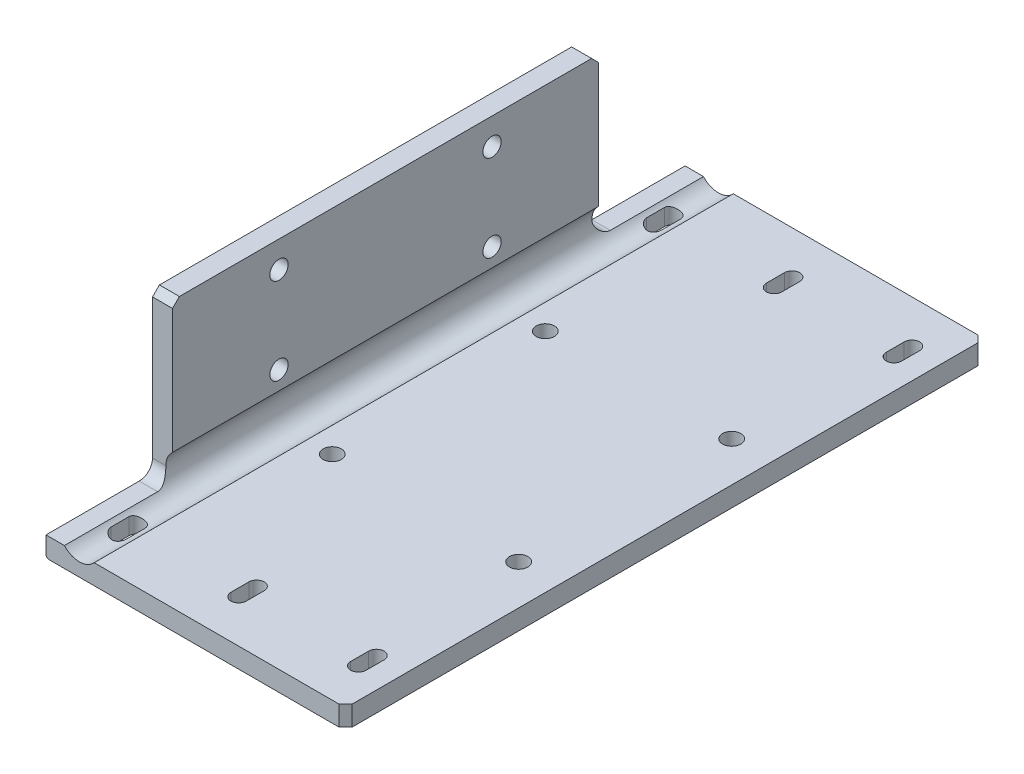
ISO-10303-21;
HEADER;
FILE_DESCRIPTION(('STEP AP214'),'2;1');
FILE_NAME('part.step','',(''),(''),'','','');
FILE_SCHEMA(('AUTOMOTIVE_DESIGN { 1 0 10303 214 1 1 1 1 }'));
ENDSEC;
DATA;
#1=APPLICATION_CONTEXT('core data for automotive mechanical design processes');
#2=APPLICATION_PROTOCOL_DEFINITION('international standard','automotive_design',2000,#1);
#3=PRODUCT_CONTEXT('',#1,'mechanical');
#4=PRODUCT('Part','Part','',(#3));
#5=PRODUCT_RELATED_PRODUCT_CATEGORY('part','',(#4));
#6=PRODUCT_DEFINITION_FORMATION('','',#4);
#7=PRODUCT_DEFINITION_CONTEXT('part definition',#1,'design');
#8=PRODUCT_DEFINITION('design','',#6,#7);
#9=PRODUCT_DEFINITION_SHAPE('','',#8);
#10=(LENGTH_UNIT() NAMED_UNIT(*) SI_UNIT(.MILLI.,.METRE.));
#11=(NAMED_UNIT(*) PLANE_ANGLE_UNIT() SI_UNIT($,.RADIAN.));
#12=(NAMED_UNIT(*) SI_UNIT($,.STERADIAN.) SOLID_ANGLE_UNIT());
#13=UNCERTAINTY_MEASURE_WITH_UNIT(LENGTH_MEASURE(1.E-05),#10,'distance_accuracy_value','');
#14=(GEOMETRIC_REPRESENTATION_CONTEXT(3) GLOBAL_UNCERTAINTY_ASSIGNED_CONTEXT((#13)) GLOBAL_UNIT_ASSIGNED_CONTEXT((#10,
#11,#12)) REPRESENTATION_CONTEXT('',''));
#15=CARTESIAN_POINT('',(0.,0.,0.));
#16=DIRECTION('',(0.,0.,1.));
#17=DIRECTION('',(1.,0.,0.));
#18=AXIS2_PLACEMENT_3D('',#15,#16,#17);
#19=CARTESIAN_POINT('',(-9.52499999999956,142.875000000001,152.399999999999));
#20=DIRECTION('',(0.999999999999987,0.,0.));
#21=DIRECTION('',(0.,1.,0.));
#22=AXIS2_PLACEMENT_3D('',#19,#20,#21);
#23=PLANE('',#22);
#24=CARTESIAN_POINT('',(-9.5249999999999,63.5,-50.7999999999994));
#25=DIRECTION('',(-0.999999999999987,0.,0.));
#26=DIRECTION('',(0.,0.,0.99999999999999));
#27=AXIS2_PLACEMENT_3D('',#24,#25,#26);
#28=CIRCLE('',#27,4.36498999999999);
#29=CARTESIAN_POINT('',(-9.5249999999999,63.5,-46.4350099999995));
#30=VERTEX_POINT('',#29);
#31=EDGE_CURVE('E1494',#30,#30,#28,.T.);
#32=ORIENTED_EDGE('',*,*,#31,.F.);
#33=EDGE_LOOP('',(#32));
#34=FACE_BOUND('',#33,.T.);
#35=CARTESIAN_POINT('',(-9.52499999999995,22.2250000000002,-50.7999999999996));
#36=DIRECTION('',(-0.999999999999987,0.,0.));
#37=DIRECTION('',(0.,0.,0.99999999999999));
#38=AXIS2_PLACEMENT_3D('',#35,#36,#37);
#39=CIRCLE('',#38,4.36498999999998);
#40=CARTESIAN_POINT('',(-9.52499999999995,22.2250000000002,-46.4350099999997));
#41=VERTEX_POINT('',#40);
#42=EDGE_CURVE('E1498',#41,#41,#39,.T.);
#43=ORIENTED_EDGE('',*,*,#42,.F.);
#44=EDGE_LOOP('',(#43));
#45=FACE_BOUND('',#44,.T.);
#46=CARTESIAN_POINT('',(-9.52499999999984,22.225,50.7999999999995));
#47=DIRECTION('',(-0.999999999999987,0.,0.));
#48=DIRECTION('',(0.,0.,0.99999999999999));
#49=AXIS2_PLACEMENT_3D('',#46,#47,#48);
#50=CIRCLE('',#49,4.36498999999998);
#51=CARTESIAN_POINT('',(-9.52499999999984,22.225,55.1649899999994));
#52=VERTEX_POINT('',#51);
#53=EDGE_CURVE('E1291',#52,#52,#50,.T.);
#54=ORIENTED_EDGE('',*,*,#53,.F.);
#55=EDGE_LOOP('',(#54));
#56=FACE_BOUND('',#55,.T.);
#57=DIRECTION('',(0.,0.,0.99999999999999));
#58=VECTOR('',#57,1.);
#59=CARTESIAN_POINT('',(-9.52500000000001,76.2000000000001,-101.599999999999));
#60=LINE('',#59,#58);
#61=CARTESIAN_POINT('',(-9.52500000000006,76.2000000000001,-98.2979999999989));
#62=VERTEX_POINT('',#61);
#63=CARTESIAN_POINT('',(-9.5249999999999,76.2000000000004,98.297999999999));
#64=VERTEX_POINT('',#63);
#65=EDGE_CURVE('E1263',#62,#64,#60,.T.);
#66=ORIENTED_EDGE('',*,*,#65,.F.);
#67=DIRECTION('',(0.,0.707106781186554,0.707106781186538));
#68=VECTOR('',#67,1.);
#69=CARTESIAN_POINT('',(-9.52500000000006,76.2000000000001,-98.2979999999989));
#70=LINE('',#69,#68);
#71=CARTESIAN_POINT('',(-9.52500000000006,72.8980000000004,-101.599999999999));
#72=VERTEX_POINT('',#71);
#73=EDGE_CURVE('E880',#62,#72,#70,.F.);
#74=ORIENTED_EDGE('',*,*,#73,.T.);
#75=DIRECTION('',(0.,1.,0.));
#76=VECTOR('',#75,1.);
#77=CARTESIAN_POINT('',(-9.52500000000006,142.875,-101.599999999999));
#78=LINE('',#77,#76);
#79=CARTESIAN_POINT('',(-9.52500000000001,6.35000000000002,-101.599999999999));
#80=VERTEX_POINT('',#79);
#81=EDGE_CURVE('E1233',#80,#72,#78,.T.);
#82=ORIENTED_EDGE('',*,*,#81,.F.);
#83=CARTESIAN_POINT('',(-9.52499999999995,6.34999999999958,-107.949999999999));
#84=DIRECTION('',(0.999999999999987,0.,0.));
#85=DIRECTION('',(0.,1.,0.));
#86=AXIS2_PLACEMENT_3D('',#83,#84,#85);
#87=CIRCLE('',#86,6.35);
#88=CARTESIAN_POINT('',(-9.52500000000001,-5.55111512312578E-13,-107.949999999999));
#89=VERTEX_POINT('',#88);
#90=EDGE_CURVE('E506',#80,#89,#87,.T.);
#91=ORIENTED_EDGE('',*,*,#90,.T.);
#92=DIRECTION('',(0.,0.,0.99999999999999));
#93=VECTOR('',#92,1.);
#94=CARTESIAN_POINT('',(-9.52500000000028,1.66533453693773E-13,-152.399999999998));
#95=LINE('',#94,#93);
#96=CARTESIAN_POINT('',(-9.52500000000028,1.66533453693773E-13,-152.399999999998));
#97=VERTEX_POINT('',#96);
#98=EDGE_CURVE('E1231',#97,#89,#95,.T.);
#99=ORIENTED_EDGE('',*,*,#98,.F.);
#100=DIRECTION('',(0.,-1.,0.));
#101=VECTOR('',#100,1.);
#102=CARTESIAN_POINT('',(-9.52500000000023,142.875000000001,-152.399999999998));
#103=LINE('',#102,#101);
#104=CARTESIAN_POINT('',(-9.52500000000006,-8.0009999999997,-152.399999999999));
#105=VERTEX_POINT('',#104);
#106=EDGE_CURVE('E787',#97,#105,#103,.T.);
#107=ORIENTED_EDGE('',*,*,#106,.T.);
#108=DIRECTION('',(0.,0.,-0.99999999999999));
#109=VECTOR('',#108,1.);
#110=CARTESIAN_POINT('',(-9.52499999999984,-8.0010000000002,152.399999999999));
#111=LINE('',#110,#109);
#112=CARTESIAN_POINT('',(-9.52499999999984,-8.0010000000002,152.399999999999));
#113=VERTEX_POINT('',#112);
#114=EDGE_CURVE('E812',#113,#105,#111,.T.);
#115=ORIENTED_EDGE('',*,*,#114,.F.);
#116=DIRECTION('',(0.,-1.,0.));
#117=VECTOR('',#116,1.);
#118=CARTESIAN_POINT('',(-9.52499999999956,142.875000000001,152.399999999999));
#119=LINE('',#118,#117);
#120=CARTESIAN_POINT('',(-9.5249999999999,0.,152.399999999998));
#121=VERTEX_POINT('',#120);
#122=EDGE_CURVE('E791',#121,#113,#119,.T.);
#123=ORIENTED_EDGE('',*,*,#122,.F.);
#124=DIRECTION('',(0.,0.,0.99999999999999));
#125=VECTOR('',#124,1.);
#126=CARTESIAN_POINT('',(-9.52499999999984,0.,152.399999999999));
#127=LINE('',#126,#125);
#128=CARTESIAN_POINT('',(-9.52499999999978,-1.11022302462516E-13,107.949999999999));
#129=VERTEX_POINT('',#128);
#130=EDGE_CURVE('E1234',#129,#121,#127,.T.);
#131=ORIENTED_EDGE('',*,*,#130,.F.);
#132=CARTESIAN_POINT('',(-9.52499999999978,6.34999999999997,107.949999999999));
#133=DIRECTION('',(0.999999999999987,0.,0.));
#134=DIRECTION('',(0.,1.,0.));
#135=AXIS2_PLACEMENT_3D('',#132,#133,#134);
#136=CIRCLE('',#135,6.35);
#137=CARTESIAN_POINT('',(-9.52500000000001,6.34999999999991,101.599999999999));
#138=VERTEX_POINT('',#137);
#139=EDGE_CURVE('E953',#129,#138,#136,.T.);
#140=ORIENTED_EDGE('',*,*,#139,.T.);
#141=DIRECTION('',(0.,-1.00000000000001,0.));
#142=VECTOR('',#141,1.);
#143=CARTESIAN_POINT('',(-9.52499999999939,142.875000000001,101.599999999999));
#144=LINE('',#143,#142);
#145=CARTESIAN_POINT('',(-9.52499999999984,72.8980000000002,101.599999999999));
#146=VERTEX_POINT('',#145);
#147=EDGE_CURVE('E1230',#146,#138,#144,.T.);
#148=ORIENTED_EDGE('',*,*,#147,.F.);
#149=DIRECTION('',(0.,-0.70710678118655,0.707106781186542));
#150=VECTOR('',#149,1.);
#151=CARTESIAN_POINT('',(-9.5249999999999,72.8980000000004,101.599999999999));
#152=LINE('',#151,#150);
#153=EDGE_CURVE('E878',#146,#64,#152,.F.);
#154=ORIENTED_EDGE('',*,*,#153,.T.);
#155=EDGE_LOOP('',(#66,#74,#82,#91,#99,#107,#115,#123,#131,#140,#148,#154));
#156=FACE_BOUND('',#155,.T.);
#157=CARTESIAN_POINT('',(-9.52499999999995,63.5000000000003,50.7999999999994));
#158=DIRECTION('',(-0.999999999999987,0.,0.));
#159=DIRECTION('',(0.,0.,0.99999999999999));
#160=AXIS2_PLACEMENT_3D('',#157,#158,#159);
#161=CIRCLE('',#160,4.36498999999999);
#162=CARTESIAN_POINT('',(-9.52499999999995,63.5000000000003,55.1649899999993));
#163=VERTEX_POINT('',#162);
#164=EDGE_CURVE('E1290',#163,#163,#161,.T.);
#165=ORIENTED_EDGE('',*,*,#164,.F.);
#166=EDGE_LOOP('',(#165));
#167=FACE_BOUND('',#166,.T.);
#168=ADVANCED_FACE('F492',(#34,#45,#56,#156,#167),#23,.F.);
#169=CARTESIAN_POINT('',(-8.00099999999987,-9.52500000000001,152.399999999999));
#170=DIRECTION('',(0.,1.,0.));
#171=DIRECTION('',(-0.999999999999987,0.,0.));
#172=AXIS2_PLACEMENT_3D('',#169,#170,#171);
#173=PLANE('',#172);
#174=CARTESIAN_POINT('',(25.3999999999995,-9.52500000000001,50.7999999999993));
#175=DIRECTION('',(0.,-1.,0.));
#176=DIRECTION('',(0.,0.,-0.99999999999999));
#177=AXIS2_PLACEMENT_3D('',#174,#175,#176);
#178=CIRCLE('',#177,4.36498999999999);
#179=CARTESIAN_POINT('',(25.3999999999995,-9.52500000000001,46.4350099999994));
#180=VERTEX_POINT('',#179);
#181=EDGE_CURVE('E1295',#180,#180,#178,.T.);
#182=ORIENTED_EDGE('',*,*,#181,.F.);
#183=EDGE_LOOP('',(#182));
#184=FACE_BOUND('',#183,.T.);
#185=CARTESIAN_POINT('',(25.3999999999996,-9.52500000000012,-50.7999999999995));
#186=DIRECTION('',(0.,-1.,0.));
#187=DIRECTION('',(0.,0.,-0.99999999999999));
#188=AXIS2_PLACEMENT_3D('',#185,#186,#187);
#189=CIRCLE('',#188,4.36498999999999);
#190=CARTESIAN_POINT('',(25.3999999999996,-9.52500000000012,-55.1649899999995));
#191=VERTEX_POINT('',#190);
#192=EDGE_CURVE('E1294',#191,#191,#189,.T.);
#193=ORIENTED_EDGE('',*,*,#192,.F.);
#194=EDGE_LOOP('',(#193));
#195=FACE_BOUND('',#194,.T.);
#196=CARTESIAN_POINT('',(114.299999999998,-9.52500000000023,-50.7999999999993));
#197=DIRECTION('',(0.,-1.,0.));
#198=DIRECTION('',(0.,0.,-0.99999999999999));
#199=AXIS2_PLACEMENT_3D('',#196,#197,#198);
#200=CIRCLE('',#199,4.36498999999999);
#201=CARTESIAN_POINT('',(114.299999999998,-9.52500000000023,-55.1649899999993));
#202=VERTEX_POINT('',#201);
#203=EDGE_CURVE('E1298',#202,#202,#200,.T.);
#204=ORIENTED_EDGE('',*,*,#203,.F.);
#205=EDGE_LOOP('',(#204));
#206=FACE_BOUND('',#205,.T.);
#207=CARTESIAN_POINT('',(4.76250000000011,-9.5250000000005,131.991099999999));
#208=DIRECTION('',(0.,-1.,0.));
#209=DIRECTION('',(0.,0.,-0.99999999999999));
#210=AXIS2_PLACEMENT_3D('',#207,#208,#209);
#211=CIRCLE('',#210,3.65759999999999);
#212=CARTESIAN_POINT('',(8.4201000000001,-9.52500000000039,131.991099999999));
#213=VERTEX_POINT('',#212);
#214=CARTESIAN_POINT('',(1.10490000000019,-9.52500000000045,131.991099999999));
#215=VERTEX_POINT('',#214);
#216=EDGE_CURVE('E1110',#213,#215,#211,.T.);
#217=ORIENTED_EDGE('',*,*,#216,.F.);
#218=DIRECTION('',(0.,0.,0.99999999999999));
#219=VECTOR('',#218,1.);
#220=CARTESIAN_POINT('',(8.42009999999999,-9.52500000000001,123.431299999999));
#221=LINE('',#220,#219);
#222=CARTESIAN_POINT('',(8.42009999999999,-9.52500000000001,123.431299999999));
#223=VERTEX_POINT('',#222);
#224=EDGE_CURVE('E1339',#223,#213,#221,.T.);
#225=ORIENTED_EDGE('',*,*,#224,.F.);
#226=CARTESIAN_POINT('',(4.76250000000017,-9.52499999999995,123.431299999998));
#227=DIRECTION('',(0.,-1.,0.));
#228=DIRECTION('',(0.,0.,-0.99999999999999));
#229=AXIS2_PLACEMENT_3D('',#226,#227,#228);
#230=CIRCLE('',#229,3.65759999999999);
#231=CARTESIAN_POINT('',(1.10490000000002,-9.52500000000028,123.431299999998));
#232=VERTEX_POINT('',#231);
#233=EDGE_CURVE('E1347',#232,#223,#230,.T.);
#234=ORIENTED_EDGE('',*,*,#233,.F.);
#235=DIRECTION('',(0.,0.,0.99999999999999));
#236=VECTOR('',#235,1.);
#237=CARTESIAN_POINT('',(1.10490000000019,-9.52500000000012,123.431299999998));
#238=LINE('',#237,#236);
#239=EDGE_CURVE('E1342',#232,#215,#238,.T.);
#240=ORIENTED_EDGE('',*,*,#239,.T.);
#241=EDGE_LOOP('',(#217,#225,#234,#240));
#242=FACE_BOUND('',#241,.T.);
#243=CARTESIAN_POINT('',(61.9124999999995,-9.52499999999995,131.991099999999));
#244=DIRECTION('',(0.,-1.,0.));
#245=DIRECTION('',(0.,0.,-0.99999999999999));
#246=AXIS2_PLACEMENT_3D('',#243,#244,#245);
#247=CIRCLE('',#246,3.65759999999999);
#248=CARTESIAN_POINT('',(65.5700999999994,-9.52499999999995,131.991099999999));
#249=VERTEX_POINT('',#248);
#250=CARTESIAN_POINT('',(58.2548999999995,-9.52499999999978,131.991099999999));
#251=VERTEX_POINT('',#250);
#252=EDGE_CURVE('E1134',#249,#251,#247,.T.);
#253=ORIENTED_EDGE('',*,*,#252,.F.);
#254=DIRECTION('',(0.,0.,0.99999999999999));
#255=VECTOR('',#254,1.);
#256=CARTESIAN_POINT('',(65.5700999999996,-9.52500000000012,123.431299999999));
#257=LINE('',#256,#255);
#258=CARTESIAN_POINT('',(65.5700999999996,-9.52500000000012,123.431299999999));
#259=VERTEX_POINT('',#258);
#260=EDGE_CURVE('E1114',#259,#249,#257,.T.);
#261=ORIENTED_EDGE('',*,*,#260,.F.);
#262=CARTESIAN_POINT('',(61.9124999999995,-9.52500000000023,123.431299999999));
#263=DIRECTION('',(0.,-1.,0.));
#264=DIRECTION('',(0.,0.,-0.99999999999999));
#265=AXIS2_PLACEMENT_3D('',#262,#263,#264);
#266=CIRCLE('',#265,3.65759999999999);
#267=CARTESIAN_POINT('',(58.2548999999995,-9.52500000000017,123.431299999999));
#268=VERTEX_POINT('',#267);
#269=EDGE_CURVE('E1127',#268,#259,#266,.T.);
#270=ORIENTED_EDGE('',*,*,#269,.F.);
#271=DIRECTION('',(0.,0.,0.99999999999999));
#272=VECTOR('',#271,1.);
#273=CARTESIAN_POINT('',(58.2548999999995,-9.52500000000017,123.431299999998));
#274=LINE('',#273,#272);
#275=EDGE_CURVE('E1116',#268,#251,#274,.T.);
#276=ORIENTED_EDGE('',*,*,#275,.T.);
#277=EDGE_LOOP('',(#253,#261,#270,#276));
#278=FACE_BOUND('',#277,.T.);
#279=DIRECTION('',(0.,0.,-0.999999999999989));
#280=VECTOR('',#279,1.);
#281=CARTESIAN_POINT('',(133.349999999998,-9.52499999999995,152.399999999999));
#282=LINE('',#281,#280);
#283=CARTESIAN_POINT('',(133.349999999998,-9.52500000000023,149.224999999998));
#284=VERTEX_POINT('',#283);
#285=CARTESIAN_POINT('',(133.349999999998,-9.52500000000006,-149.224999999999));
#286=VERTEX_POINT('',#285);
#287=EDGE_CURVE('E1227',#284,#286,#282,.T.);
#288=ORIENTED_EDGE('',*,*,#287,.F.);
#289=DIRECTION('',(-0.707106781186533,0.,0.707106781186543));
#290=VECTOR('',#289,1.);
#291=CARTESIAN_POINT('',(133.349999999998,-9.52500000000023,149.224999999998));
#292=LINE('',#291,#290);
#293=CARTESIAN_POINT('',(130.174999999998,-9.52499999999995,152.399999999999));
#294=VERTEX_POINT('',#293);
#295=EDGE_CURVE('E822',#284,#294,#292,.T.);
#296=ORIENTED_EDGE('',*,*,#295,.T.);
#297=DIRECTION('',(0.999999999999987,0.,0.));
#298=VECTOR('',#297,1.);
#299=CARTESIAN_POINT('',(-8.00099999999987,-9.52500000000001,152.399999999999));
#300=LINE('',#299,#298);
#301=CARTESIAN_POINT('',(-8.00099999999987,-9.52500000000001,152.399999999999));
#302=VERTEX_POINT('',#301);
#303=EDGE_CURVE('E800',#302,#294,#300,.T.);
#304=ORIENTED_EDGE('',*,*,#303,.F.);
#305=DIRECTION('',(0.,0.,-0.99999999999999));
#306=VECTOR('',#305,1.);
#307=CARTESIAN_POINT('',(-8.00099999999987,-9.52500000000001,152.399999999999));
#308=LINE('',#307,#306);
#309=CARTESIAN_POINT('',(-8.00100000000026,-9.52500000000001,-152.399999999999));
#310=VERTEX_POINT('',#309);
#311=EDGE_CURVE('E810',#302,#310,#308,.T.);
#312=ORIENTED_EDGE('',*,*,#311,.T.);
#313=DIRECTION('',(0.999999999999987,0.,0.));
#314=VECTOR('',#313,1.);
#315=CARTESIAN_POINT('',(-8.00100000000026,-9.52500000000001,-152.399999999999));
#316=LINE('',#315,#314);
#317=CARTESIAN_POINT('',(130.174999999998,-9.52500000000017,-152.399999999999));
#318=VERTEX_POINT('',#317);
#319=EDGE_CURVE('E789',#310,#318,#316,.T.);
#320=ORIENTED_EDGE('',*,*,#319,.T.);
#321=DIRECTION('',(-0.707106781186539,0.,-0.707106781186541));
#322=VECTOR('',#321,1.);
#323=CARTESIAN_POINT('',(130.174999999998,-9.52500000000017,-152.399999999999));
#324=LINE('',#323,#322);
#325=EDGE_CURVE('E820',#318,#286,#324,.F.);
#326=ORIENTED_EDGE('',*,*,#325,.T.);
#327=EDGE_LOOP('',(#288,#296,#304,#312,#320,#326));
#328=FACE_BOUND('',#327,.T.);
#329=DIRECTION('',(0.,0.,-0.99999999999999));
#330=VECTOR('',#329,1.);
#331=CARTESIAN_POINT('',(122.720099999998,-9.5250000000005,-123.431299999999));
#332=LINE('',#331,#330);
#333=CARTESIAN_POINT('',(122.720099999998,-9.5250000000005,-123.431299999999));
#334=VERTEX_POINT('',#333);
#335=CARTESIAN_POINT('',(122.720099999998,-9.52500000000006,-131.991099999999));
#336=VERTEX_POINT('',#335);
#337=EDGE_CURVE('E1209',#334,#336,#332,.T.);
#338=ORIENTED_EDGE('',*,*,#337,.T.);
#339=CARTESIAN_POINT('',(119.062499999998,-9.52500000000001,-131.991099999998));
#340=DIRECTION('',(0.,-1.,0.));
#341=DIRECTION('',(0.,0.,-0.99999999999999));
#342=AXIS2_PLACEMENT_3D('',#339,#340,#341);
#343=CIRCLE('',#342,3.65759999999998);
#344=CARTESIAN_POINT('',(115.404899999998,-9.52500000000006,-131.991099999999));
#345=VERTEX_POINT('',#344);
#346=EDGE_CURVE('E1222',#345,#336,#343,.T.);
#347=ORIENTED_EDGE('',*,*,#346,.F.);
#348=DIRECTION('',(0.,0.,-0.99999999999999));
#349=VECTOR('',#348,1.);
#350=CARTESIAN_POINT('',(115.404899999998,-9.52500000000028,-123.431299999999));
#351=LINE('',#350,#349);
#352=CARTESIAN_POINT('',(115.404899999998,-9.52500000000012,-123.431299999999));
#353=VERTEX_POINT('',#352);
#354=EDGE_CURVE('E1207',#353,#345,#351,.T.);
#355=ORIENTED_EDGE('',*,*,#354,.F.);
#356=CARTESIAN_POINT('',(119.062499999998,-9.52500000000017,-123.431299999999));
#357=DIRECTION('',(0.,-1.,0.));
#358=DIRECTION('',(0.,0.,-0.99999999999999));
#359=AXIS2_PLACEMENT_3D('',#356,#357,#358);
#360=CIRCLE('',#359,3.65759999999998);
#361=EDGE_CURVE('E1214',#334,#353,#360,.T.);
#362=ORIENTED_EDGE('',*,*,#361,.F.);
#363=EDGE_LOOP('',(#338,#347,#355,#362));
#364=FACE_BOUND('',#363,.T.);
#365=DIRECTION('',(0.,0.,-0.99999999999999));
#366=VECTOR('',#365,1.);
#367=CARTESIAN_POINT('',(65.5700999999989,-9.52500000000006,-123.431299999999));
#368=LINE('',#367,#366);
#369=CARTESIAN_POINT('',(65.5700999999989,-9.52500000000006,-123.431299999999));
#370=VERTEX_POINT('',#369);
#371=CARTESIAN_POINT('',(65.570099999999,-9.52500000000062,-131.991099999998));
#372=VERTEX_POINT('',#371);
#373=EDGE_CURVE('E1188',#370,#372,#368,.T.);
#374=ORIENTED_EDGE('',*,*,#373,.T.);
#375=CARTESIAN_POINT('',(61.912499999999,-9.52500000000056,-131.991099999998));
#376=DIRECTION('',(0.,-1.,0.));
#377=DIRECTION('',(0.,0.,-0.99999999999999));
#378=AXIS2_PLACEMENT_3D('',#375,#376,#377);
#379=CIRCLE('',#378,3.65759999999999);
#380=CARTESIAN_POINT('',(58.2548999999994,-9.52500000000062,-131.991099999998));
#381=VERTEX_POINT('',#380);
#382=EDGE_CURVE('E1202',#381,#372,#379,.T.);
#383=ORIENTED_EDGE('',*,*,#382,.F.);
#384=DIRECTION('',(0.,0.,-0.99999999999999));
#385=VECTOR('',#384,1.);
#386=CARTESIAN_POINT('',(58.2548999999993,-9.52500000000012,-123.431299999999));
#387=LINE('',#386,#385);
#388=CARTESIAN_POINT('',(58.2548999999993,-9.52500000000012,-123.431299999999));
#389=VERTEX_POINT('',#388);
#390=EDGE_CURVE('E1186',#389,#381,#387,.T.);
#391=ORIENTED_EDGE('',*,*,#390,.F.);
#392=CARTESIAN_POINT('',(61.912499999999,-9.52500000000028,-123.431299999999));
#393=DIRECTION('',(0.,-1.,0.));
#394=DIRECTION('',(0.,0.,-0.99999999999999));
#395=AXIS2_PLACEMENT_3D('',#392,#393,#394);
#396=CIRCLE('',#395,3.65759999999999);
#397=EDGE_CURVE('E1194',#370,#389,#396,.T.);
#398=ORIENTED_EDGE('',*,*,#397,.F.);
#399=EDGE_LOOP('',(#374,#383,#391,#398));
#400=FACE_BOUND('',#399,.T.);
#401=DIRECTION('',(0.,0.,-0.99999999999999));
#402=VECTOR('',#401,1.);
#403=CARTESIAN_POINT('',(8.42009999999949,-9.52500000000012,-123.431299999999));
#404=LINE('',#403,#402);
#405=CARTESIAN_POINT('',(8.42009999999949,-9.52500000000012,-123.431299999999));
#406=VERTEX_POINT('',#405);
#407=CARTESIAN_POINT('',(8.42009999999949,-9.52500000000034,-131.991099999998));
#408=VERTEX_POINT('',#407);
#409=EDGE_CURVE('E1167',#406,#408,#404,.T.);
#410=ORIENTED_EDGE('',*,*,#409,.T.);
#411=CARTESIAN_POINT('',(4.7624999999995,-9.52500000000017,-131.991099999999));
#412=DIRECTION('',(0.,-1.,0.));
#413=DIRECTION('',(0.,0.,-0.99999999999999));
#414=AXIS2_PLACEMENT_3D('',#411,#412,#413);
#415=CIRCLE('',#414,3.65759999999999);
#416=CARTESIAN_POINT('',(1.10489999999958,-9.52500000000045,-131.991099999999));
#417=VERTEX_POINT('',#416);
#418=EDGE_CURVE('E1181',#417,#408,#415,.T.);
#419=ORIENTED_EDGE('',*,*,#418,.F.);
#420=DIRECTION('',(0.,0.,-0.99999999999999));
#421=VECTOR('',#420,1.);
#422=CARTESIAN_POINT('',(1.10489999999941,-9.52500000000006,-123.431299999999));
#423=LINE('',#422,#421);
#424=CARTESIAN_POINT('',(1.10489999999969,-9.5249999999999,-123.431299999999));
#425=VERTEX_POINT('',#424);
#426=EDGE_CURVE('E1165',#425,#417,#423,.T.);
#427=ORIENTED_EDGE('',*,*,#426,.F.);
#428=CARTESIAN_POINT('',(4.76249999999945,-9.5249999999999,-123.431299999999));
#429=DIRECTION('',(0.,-1.,0.));
#430=DIRECTION('',(0.,0.,-0.99999999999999));
#431=AXIS2_PLACEMENT_3D('',#428,#429,#430);
#432=CIRCLE('',#431,3.65759999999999);
#433=EDGE_CURVE('E1173',#406,#425,#432,.T.);
#434=ORIENTED_EDGE('',*,*,#433,.F.);
#435=EDGE_LOOP('',(#410,#419,#427,#434));
#436=FACE_BOUND('',#435,.T.);
#437=DIRECTION('',(0.,0.,0.99999999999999));
#438=VECTOR('',#437,1.);
#439=CARTESIAN_POINT('',(122.720099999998,-9.5250000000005,123.431299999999));
#440=LINE('',#439,#438);
#441=CARTESIAN_POINT('',(122.720099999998,-9.5250000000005,123.431299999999));
#442=VERTEX_POINT('',#441);
#443=CARTESIAN_POINT('',(122.720099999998,-9.52500000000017,131.991099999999));
#444=VERTEX_POINT('',#443);
#445=EDGE_CURVE('E1145',#442,#444,#440,.T.);
#446=ORIENTED_EDGE('',*,*,#445,.F.);
#447=CARTESIAN_POINT('',(119.062499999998,-9.52500000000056,123.431299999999));
#448=DIRECTION('',(0.,-1.,0.));
#449=DIRECTION('',(0.,0.,-0.99999999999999));
#450=AXIS2_PLACEMENT_3D('',#447,#448,#449);
#451=CIRCLE('',#450,3.65759999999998);
#452=CARTESIAN_POINT('',(115.404899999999,-9.52500000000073,123.431299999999));
#453=VERTEX_POINT('',#452);
#454=EDGE_CURVE('E1153',#453,#442,#451,.T.);
#455=ORIENTED_EDGE('',*,*,#454,.F.);
#456=DIRECTION('',(0.,0.,0.99999999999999));
#457=VECTOR('',#456,1.);
#458=CARTESIAN_POINT('',(115.404899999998,-9.52500000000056,123.431299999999));
#459=LINE('',#458,#457);
#460=CARTESIAN_POINT('',(115.404899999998,-9.52500000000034,131.991099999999));
#461=VERTEX_POINT('',#460);
#462=EDGE_CURVE('E1147',#453,#461,#459,.T.);
#463=ORIENTED_EDGE('',*,*,#462,.T.);
#464=CARTESIAN_POINT('',(119.062499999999,-9.52500000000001,131.991099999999));
#465=DIRECTION('',(0.,-1.,0.));
#466=DIRECTION('',(0.,0.,-0.99999999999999));
#467=AXIS2_PLACEMENT_3D('',#464,#465,#466);
#468=CIRCLE('',#467,3.65759999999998);
#469=EDGE_CURVE('E1160',#444,#461,#468,.T.);
#470=ORIENTED_EDGE('',*,*,#469,.F.);
#471=EDGE_LOOP('',(#446,#455,#463,#470));
#472=FACE_BOUND('',#471,.T.);
#473=CARTESIAN_POINT('',(114.299999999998,-9.5250000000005,50.7999999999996));
#474=DIRECTION('',(0.,-1.,0.));
#475=DIRECTION('',(0.,0.,-0.99999999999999));
#476=AXIS2_PLACEMENT_3D('',#473,#474,#475);
#477=CIRCLE('',#476,4.36498999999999);
#478=CARTESIAN_POINT('',(114.299999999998,-9.5250000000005,46.4350099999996));
#479=VERTEX_POINT('',#478);
#480=EDGE_CURVE('E1310',#479,#479,#477,.T.);
#481=ORIENTED_EDGE('',*,*,#480,.F.);
#482=EDGE_LOOP('',(#481));
#483=FACE_BOUND('',#482,.T.);
#484=ADVANCED_FACE('F985',(#184,#195,#206,#242,#278,#328,#364,#400,#436,#472,#483),#173,.F.);
#485=CARTESIAN_POINT('',(133.349999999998,1.11022302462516E-13,152.399999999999));
#486=DIRECTION('',(0.,-1.,0.));
#487=DIRECTION('',(0.999999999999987,0.,0.));
#488=AXIS2_PLACEMENT_3D('',#485,#486,#487);
#489=PLANE('',#488);
#490=CARTESIAN_POINT('',(25.3999999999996,-2.22044604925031E-13,50.7999999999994));
#491=DIRECTION('',(0.,-1.,0.));
#492=DIRECTION('',(0.999999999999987,0.,0.));
#493=AXIS2_PLACEMENT_3D('',#490,#491,#492);
#494=CIRCLE('',#493,4.36498999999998);
#495=CARTESIAN_POINT('',(29.7649899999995,-2.26784259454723E-13,50.7999999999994));
#496=VERTEX_POINT('',#495);
#497=EDGE_CURVE('E1292',#496,#496,#494,.T.);
#498=ORIENTED_EDGE('',*,*,#497,.T.);
#499=EDGE_LOOP('',(#498));
#500=FACE_BOUND('',#499,.T.);
#501=CARTESIAN_POINT('',(25.3999999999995,-2.77555756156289E-13,-50.7999999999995));
#502=DIRECTION('',(0.,-1.,0.));
#503=DIRECTION('',(0.999999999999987,0.,0.));
#504=AXIS2_PLACEMENT_3D('',#501,#502,#503);
#505=CIRCLE('',#504,4.36498999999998);
#506=CARTESIAN_POINT('',(29.7649899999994,-2.82295410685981E-13,-50.7999999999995));
#507=VERTEX_POINT('',#506);
#508=EDGE_CURVE('E1296',#507,#507,#505,.T.);
#509=ORIENTED_EDGE('',*,*,#508,.T.);
#510=EDGE_LOOP('',(#509));
#511=FACE_BOUND('',#510,.T.);
#512=CARTESIAN_POINT('',(114.299999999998,-2.22044604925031E-13,-50.7999999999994));
#513=DIRECTION('',(0.,-1.,0.));
#514=DIRECTION('',(0.999999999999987,0.,0.));
#515=AXIS2_PLACEMENT_3D('',#512,#513,#514);
#516=CIRCLE('',#515,4.36498999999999);
#517=CARTESIAN_POINT('',(118.664989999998,-2.26784259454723E-13,-50.7999999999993));
#518=VERTEX_POINT('',#517);
#519=EDGE_CURVE('E902',#518,#518,#516,.T.);
#520=ORIENTED_EDGE('',*,*,#519,.T.);
#521=EDGE_LOOP('',(#520));
#522=FACE_BOUND('',#521,.T.);
#523=CARTESIAN_POINT('',(114.299999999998,-4.9960036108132E-13,50.7999999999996));
#524=DIRECTION('',(0.,-1.,0.));
#525=DIRECTION('',(0.999999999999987,0.,0.));
#526=AXIS2_PLACEMENT_3D('',#523,#524,#525);
#527=CIRCLE('',#526,4.36498999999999);
#528=CARTESIAN_POINT('',(118.664989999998,-5.04340015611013E-13,50.7999999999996));
#529=VERTEX_POINT('',#528);
#530=EDGE_CURVE('E1268',#529,#529,#527,.T.);
#531=ORIENTED_EDGE('',*,*,#530,.T.);
#532=EDGE_LOOP('',(#531));
#533=FACE_BOUND('',#532,.T.);
#534=CARTESIAN_POINT('',(61.9124999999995,0.,131.991099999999));
#535=DIRECTION('',(0.,-1.,0.));
#536=DIRECTION('',(0.999999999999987,0.,0.));
#537=AXIS2_PLACEMENT_3D('',#534,#535,#536);
#538=CIRCLE('',#537,3.65759999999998);
#539=CARTESIAN_POINT('',(65.5700999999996,-1.11022302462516E-13,131.991099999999));
#540=VERTEX_POINT('',#539);
#541=CARTESIAN_POINT('',(58.2548999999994,1.11022302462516E-13,131.991099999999));
#542=VERTEX_POINT('',#541);
#543=EDGE_CURVE('E1142',#540,#542,#538,.T.);
#544=ORIENTED_EDGE('',*,*,#543,.T.);
#545=DIRECTION('',(0.,0.,-0.99999999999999));
#546=VECTOR('',#545,1.);
#547=CARTESIAN_POINT('',(58.2548999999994,-2.22044604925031E-13,152.399999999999));
#548=LINE('',#547,#546);
#549=CARTESIAN_POINT('',(58.2548999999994,-1.66533453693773E-13,123.431299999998));
#550=VERTEX_POINT('',#549);
#551=EDGE_CURVE('E870',#542,#550,#548,.T.);
#552=ORIENTED_EDGE('',*,*,#551,.T.);
#553=CARTESIAN_POINT('',(61.9124999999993,-1.11022302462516E-13,123.431299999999));
#554=DIRECTION('',(0.,-1.,0.));
#555=DIRECTION('',(0.999999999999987,0.,0.));
#556=AXIS2_PLACEMENT_3D('',#553,#554,#555);
#557=CIRCLE('',#556,3.65759999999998);
#558=CARTESIAN_POINT('',(65.5700999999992,-1.11022302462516E-13,123.431299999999));
#559=VERTEX_POINT('',#558);
#560=EDGE_CURVE('E867',#550,#559,#557,.T.);
#561=ORIENTED_EDGE('',*,*,#560,.T.);
#562=DIRECTION('',(0.,0.,0.99999999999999));
#563=VECTOR('',#562,1.);
#564=CARTESIAN_POINT('',(65.5700999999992,-5.55111512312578E-13,152.399999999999));
#565=LINE('',#564,#563);
#566=EDGE_CURVE('E1139',#559,#540,#565,.T.);
#567=ORIENTED_EDGE('',*,*,#566,.T.);
#568=EDGE_LOOP('',(#544,#552,#561,#567));
#569=FACE_BOUND('',#568,.T.);
#570=CARTESIAN_POINT('',(119.062499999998,-3.88578058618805E-13,131.991099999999));
#571=DIRECTION('',(0.,-1.,0.));
#572=DIRECTION('',(0.999999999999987,0.,0.));
#573=AXIS2_PLACEMENT_3D('',#570,#571,#572);
#574=CIRCLE('',#573,3.65759999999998);
#575=CARTESIAN_POINT('',(122.720099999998,-2.77555756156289E-13,131.991099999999));
#576=VERTEX_POINT('',#575);
#577=CARTESIAN_POINT('',(115.404899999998,-1.66533453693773E-13,131.991099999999));
#578=VERTEX_POINT('',#577);
#579=EDGE_CURVE('E858',#576,#578,#574,.T.);
#580=ORIENTED_EDGE('',*,*,#579,.T.);
#581=DIRECTION('',(0.,0.,-0.99999999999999));
#582=VECTOR('',#581,1.);
#583=CARTESIAN_POINT('',(115.404899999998,0.,152.399999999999));
#584=LINE('',#583,#582);
#585=CARTESIAN_POINT('',(115.404899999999,-4.44089209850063E-13,123.431299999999));
#586=VERTEX_POINT('',#585);
#587=EDGE_CURVE('E864',#578,#586,#584,.T.);
#588=ORIENTED_EDGE('',*,*,#587,.T.);
#589=CARTESIAN_POINT('',(119.062499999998,-2.77555756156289E-13,123.431299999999));
#590=DIRECTION('',(0.,-1.,0.));
#591=DIRECTION('',(0.999999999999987,0.,0.));
#592=AXIS2_PLACEMENT_3D('',#589,#590,#591);
#593=CIRCLE('',#592,3.65759999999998);
#594=CARTESIAN_POINT('',(122.720099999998,-4.44089209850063E-13,123.431299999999));
#595=VERTEX_POINT('',#594);
#596=EDGE_CURVE('E861',#586,#595,#593,.T.);
#597=ORIENTED_EDGE('',*,*,#596,.T.);
#598=DIRECTION('',(0.,0.,0.99999999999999));
#599=VECTOR('',#598,1.);
#600=CARTESIAN_POINT('',(122.720099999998,0.,152.399999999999));
#601=LINE('',#600,#599);
#602=EDGE_CURVE('E855',#595,#576,#601,.T.);
#603=ORIENTED_EDGE('',*,*,#602,.T.);
#604=EDGE_LOOP('',(#580,#588,#597,#603));
#605=FACE_BOUND('',#604,.T.);
#606=CARTESIAN_POINT('',(119.062499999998,-3.88578058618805E-13,-123.431299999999));
#607=DIRECTION('',(0.,-1.,0.));
#608=DIRECTION('',(0.999999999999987,0.,0.));
#609=AXIS2_PLACEMENT_3D('',#606,#607,#608);
#610=CIRCLE('',#609,3.65759999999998);
#611=CARTESIAN_POINT('',(122.720099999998,-5.55111512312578E-13,-123.431299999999));
#612=VERTEX_POINT('',#611);
#613=CARTESIAN_POINT('',(115.404899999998,-2.77555756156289E-13,-123.431299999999));
#614=VERTEX_POINT('',#613);
#615=EDGE_CURVE('E835',#612,#614,#610,.T.);
#616=ORIENTED_EDGE('',*,*,#615,.T.);
#617=DIRECTION('',(0.,0.,-0.99999999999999));
#618=VECTOR('',#617,1.);
#619=CARTESIAN_POINT('',(115.404899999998,0.,152.399999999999));
#620=LINE('',#619,#618);
#621=CARTESIAN_POINT('',(115.404899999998,0.,-131.991099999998));
#622=VERTEX_POINT('',#621);
#623=EDGE_CURVE('E841',#614,#622,#620,.T.);
#624=ORIENTED_EDGE('',*,*,#623,.T.);
#625=CARTESIAN_POINT('',(119.062499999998,0.,-131.991099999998));
#626=DIRECTION('',(0.,-1.,0.));
#627=DIRECTION('',(0.999999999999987,0.,0.));
#628=AXIS2_PLACEMENT_3D('',#625,#626,#627);
#629=CIRCLE('',#628,3.65759999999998);
#630=CARTESIAN_POINT('',(122.720099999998,0.,-131.991099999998));
#631=VERTEX_POINT('',#630);
#632=EDGE_CURVE('E838',#622,#631,#629,.T.);
#633=ORIENTED_EDGE('',*,*,#632,.T.);
#634=DIRECTION('',(0.,0.,-0.99999999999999));
#635=VECTOR('',#634,1.);
#636=CARTESIAN_POINT('',(122.720099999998,0.,152.399999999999));
#637=LINE('',#636,#635);
#638=EDGE_CURVE('E833',#612,#631,#637,.T.);
#639=ORIENTED_EDGE('',*,*,#638,.F.);
#640=EDGE_LOOP('',(#616,#624,#633,#639));
#641=FACE_BOUND('',#640,.T.);
#642=DIRECTION('',(0.,0.,-0.99999999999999));
#643=VECTOR('',#642,1.);
#644=CARTESIAN_POINT('',(58.2548999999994,-2.22044604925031E-13,152.399999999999));
#645=LINE('',#644,#643);
#646=CARTESIAN_POINT('',(58.2548999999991,-1.66533453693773E-13,-123.431299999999));
#647=VERTEX_POINT('',#646);
#648=CARTESIAN_POINT('',(58.2548999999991,-4.44089209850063E-13,-131.991099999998));
#649=VERTEX_POINT('',#648);
#650=EDGE_CURVE('E847',#647,#649,#645,.T.);
#651=ORIENTED_EDGE('',*,*,#650,.T.);
#652=CARTESIAN_POINT('',(61.912499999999,-6.10622663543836E-13,-131.991099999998));
#653=DIRECTION('',(0.,-1.,0.));
#654=DIRECTION('',(0.999999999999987,0.,0.));
#655=AXIS2_PLACEMENT_3D('',#652,#653,#654);
#656=CIRCLE('',#655,3.65759999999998);
#657=CARTESIAN_POINT('',(65.570099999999,-5.55111512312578E-13,-131.991099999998));
#658=VERTEX_POINT('',#657);
#659=EDGE_CURVE('E852',#649,#658,#656,.T.);
#660=ORIENTED_EDGE('',*,*,#659,.T.);
#661=DIRECTION('',(0.,0.,-0.99999999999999));
#662=VECTOR('',#661,1.);
#663=CARTESIAN_POINT('',(65.5700999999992,-5.55111512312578E-13,152.399999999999));
#664=LINE('',#663,#662);
#665=CARTESIAN_POINT('',(65.5700999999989,-2.22044604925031E-13,-123.431299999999));
#666=VERTEX_POINT('',#665);
#667=EDGE_CURVE('E850',#666,#658,#664,.T.);
#668=ORIENTED_EDGE('',*,*,#667,.F.);
#669=CARTESIAN_POINT('',(61.9124999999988,-3.33066907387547E-13,-123.431299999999));
#670=DIRECTION('',(0.,-1.,0.));
#671=DIRECTION('',(0.999999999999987,0.,0.));
#672=AXIS2_PLACEMENT_3D('',#669,#670,#671);
#673=CIRCLE('',#672,3.65759999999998);
#674=EDGE_CURVE('E844',#666,#647,#673,.T.);
#675=ORIENTED_EDGE('',*,*,#674,.T.);
#676=EDGE_LOOP('',(#651,#660,#668,#675));
#677=FACE_BOUND('',#676,.T.);
#678=DIRECTION('',(-0.999999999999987,0.,0.));
#679=VECTOR('',#678,1.);
#680=CARTESIAN_POINT('',(133.349999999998,-2.22044604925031E-13,-152.399999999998));
#681=LINE('',#680,#679);
#682=CARTESIAN_POINT('',(130.174999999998,-2.77555756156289E-13,-152.399999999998));
#683=VERTEX_POINT('',#682);
#684=CARTESIAN_POINT('',(13.4495158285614,0.,-152.399999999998));
#685=VERTEX_POINT('',#684);
#686=EDGE_CURVE('E788',#683,#685,#681,.T.);
#687=ORIENTED_EDGE('',*,*,#686,.T.);
#688=DIRECTION('',(0.,0.,0.99999999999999));
#689=VECTOR('',#688,1.);
#690=CARTESIAN_POINT('',(13.4495158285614,0.,-152.399999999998));
#691=LINE('',#690,#689);
#692=CARTESIAN_POINT('',(13.4495158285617,0.,152.399999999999));
#693=VERTEX_POINT('',#692);
#694=EDGE_CURVE('E770',#685,#693,#691,.T.);
#695=ORIENTED_EDGE('',*,*,#694,.T.);
#696=DIRECTION('',(-0.999999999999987,0.,0.));
#697=VECTOR('',#696,1.);
#698=CARTESIAN_POINT('',(133.349999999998,1.11022302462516E-13,152.399999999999));
#699=LINE('',#698,#697);
#700=CARTESIAN_POINT('',(130.174999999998,0.,152.399999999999));
#701=VERTEX_POINT('',#700);
#702=EDGE_CURVE('E804',#701,#693,#699,.T.);
#703=ORIENTED_EDGE('',*,*,#702,.F.);
#704=DIRECTION('',(0.707106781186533,0.,-0.707106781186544));
#705=VECTOR('',#704,1.);
#706=CARTESIAN_POINT('',(133.349999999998,-3.33066907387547E-13,149.224999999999));
#707=LINE('',#706,#705);
#708=CARTESIAN_POINT('',(133.349999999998,0.,149.224999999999));
#709=VERTEX_POINT('',#708);
#710=EDGE_CURVE('E828',#701,#709,#707,.T.);
#711=ORIENTED_EDGE('',*,*,#710,.T.);
#712=DIRECTION('',(0.,0.,-0.99999999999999));
#713=VECTOR('',#712,1.);
#714=CARTESIAN_POINT('',(133.349999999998,1.11022302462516E-13,152.399999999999));
#715=LINE('',#714,#713);
#716=CARTESIAN_POINT('',(133.349999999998,0.,-149.224999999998));
#717=VERTEX_POINT('',#716);
#718=EDGE_CURVE('E807',#709,#717,#715,.T.);
#719=ORIENTED_EDGE('',*,*,#718,.T.);
#720=DIRECTION('',(0.707106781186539,0.,0.707106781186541));
#721=VECTOR('',#720,1.);
#722=CARTESIAN_POINT('',(130.174999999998,-2.77555756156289E-13,-152.399999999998));
#723=LINE('',#722,#721);
#724=EDGE_CURVE('E826',#717,#683,#723,.F.);
#725=ORIENTED_EDGE('',*,*,#724,.T.);
#726=EDGE_LOOP('',(#687,#695,#703,#711,#719,#725));
#727=FACE_BOUND('',#726,.T.);
#728=ADVANCED_FACE('F995',(#500,#511,#522,#533,#569,#605,#641,#677,#727),#489,.F.);
#729=DIRECTION('',(0.,0.,0.99999999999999));
#730=VECTOR('',#729,1.);
#731=CARTESIAN_POINT('',(-0.749515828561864,1.66533453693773E-13,-152.399999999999));
#732=LINE('',#731,#730);
#733=CARTESIAN_POINT('',(-0.749515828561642,-1.66533453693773E-13,152.399999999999));
#734=VERTEX_POINT('',#733);
#735=CARTESIAN_POINT('',(-0.749515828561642,-1.66533453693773E-13,107.949999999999));
#736=VERTEX_POINT('',#735);
#737=EDGE_CURVE('E773',#734,#736,#732,.F.);
#738=ORIENTED_EDGE('',*,*,#737,.T.);
#739=DIRECTION('',(-0.999999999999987,0.,0.));
#740=VECTOR('',#739,1.);
#741=CARTESIAN_POINT('',(-9.52499999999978,-2.22044604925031E-13,107.949999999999));
#742=LINE('',#741,#740);
#743=EDGE_CURVE('E901',#736,#129,#742,.T.);
#744=ORIENTED_EDGE('',*,*,#743,.T.);
#745=ORIENTED_EDGE('',*,*,#130,.T.);
#746=EDGE_CURVE('E803',#734,#121,#699,.T.);
#747=ORIENTED_EDGE('',*,*,#746,.F.);
#748=EDGE_LOOP('',(#738,#744,#745,#747));
#749=FACE_BOUND('',#748,.T.);
#750=ADVANCED_FACE('F999',(#749),#489,.F.);
#751=ORIENTED_EDGE('',*,*,#98,.T.);
#752=DIRECTION('',(-0.999999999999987,0.,0.));
#753=VECTOR('',#752,1.);
#754=CARTESIAN_POINT('',(-0.749515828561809,1.11022302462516E-13,-107.949999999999));
#755=LINE('',#754,#753);
#756=CARTESIAN_POINT('',(-0.749515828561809,1.11022302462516E-13,-107.949999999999));
#757=VERTEX_POINT('',#756);
#758=EDGE_CURVE('E519',#89,#757,#755,.F.);
#759=ORIENTED_EDGE('',*,*,#758,.T.);
#760=CARTESIAN_POINT('',(-0.749515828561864,1.66533453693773E-13,-152.399999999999));
#761=VERTEX_POINT('',#760);
#762=EDGE_CURVE('E763',#757,#761,#732,.F.);
#763=ORIENTED_EDGE('',*,*,#762,.T.);
#764=EDGE_CURVE('E767',#761,#97,#681,.T.);
#765=ORIENTED_EDGE('',*,*,#764,.T.);
#766=EDGE_LOOP('',(#751,#759,#763,#765));
#767=FACE_BOUND('',#766,.T.);
#768=ADVANCED_FACE('F765',(#767),#489,.F.);
#769=CARTESIAN_POINT('',(0.,12.6999999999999,152.399999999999));
#770=DIRECTION('',(-0.999999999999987,0.,0.));
#771=DIRECTION('',(0.,-1.,0.));
#772=AXIS2_PLACEMENT_3D('',#769,#770,#771);
#773=PLANE('',#772);
#774=CARTESIAN_POINT('',(0.,63.5000000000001,-50.7999999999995));
#775=DIRECTION('',(-0.999999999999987,0.,0.));
#776=DIRECTION('',(0.,-1.,0.));
#777=AXIS2_PLACEMENT_3D('',#774,#775,#776);
#778=CIRCLE('',#777,4.36498999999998);
#779=CARTESIAN_POINT('',(0.,63.5,-46.4350099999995));
#780=VERTEX_POINT('',#779);
#781=EDGE_CURVE('E1497',#780,#780,#778,.T.);
#782=ORIENTED_EDGE('',*,*,#781,.T.);
#783=EDGE_LOOP('',(#782));
#784=FACE_BOUND('',#783,.T.);
#785=CARTESIAN_POINT('',(-1.11022302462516E-13,22.2250000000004,-50.7999999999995));
#786=DIRECTION('',(-0.999999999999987,0.,0.));
#787=DIRECTION('',(0.,-1.,0.));
#788=AXIS2_PLACEMENT_3D('',#785,#786,#787);
#789=CIRCLE('',#788,4.36498999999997);
#790=CARTESIAN_POINT('',(-1.14491749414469E-13,22.2250000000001,-46.4350099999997));
#791=VERTEX_POINT('',#790);
#792=EDGE_CURVE('E1501',#791,#791,#789,.T.);
#793=ORIENTED_EDGE('',*,*,#792,.T.);
#794=EDGE_LOOP('',(#793));
#795=FACE_BOUND('',#794,.T.);
#796=CARTESIAN_POINT('',(0.,22.2249999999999,50.7999999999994));
#797=DIRECTION('',(-0.999999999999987,0.,0.));
#798=DIRECTION('',(0.,-1.,0.));
#799=AXIS2_PLACEMENT_3D('',#796,#797,#798);
#800=CIRCLE('',#799,4.36498999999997);
#801=CARTESIAN_POINT('',(0.,22.225,55.1649899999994));
#802=VERTEX_POINT('',#801);
#803=EDGE_CURVE('E1287',#802,#802,#800,.T.);
#804=ORIENTED_EDGE('',*,*,#803,.T.);
#805=EDGE_LOOP('',(#804));
#806=FACE_BOUND('',#805,.T.);
#807=CARTESIAN_POINT('',(0.,63.5000000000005,50.7999999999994));
#808=DIRECTION('',(-0.999999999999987,0.,0.));
#809=DIRECTION('',(0.,-1.,0.));
#810=AXIS2_PLACEMENT_3D('',#807,#808,#809);
#811=CIRCLE('',#810,4.36498999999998);
#812=CARTESIAN_POINT('',(0.,63.5000000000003,55.1649899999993));
#813=VERTEX_POINT('',#812);
#814=EDGE_CURVE('E1510',#813,#813,#811,.T.);
#815=ORIENTED_EDGE('',*,*,#814,.T.);
#816=EDGE_LOOP('',(#815));
#817=FACE_BOUND('',#816,.T.);
#818=DIRECTION('',(0.,-1.00000000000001,0.));
#819=VECTOR('',#818,1.);
#820=CARTESIAN_POINT('',(0.,12.7,101.599999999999));
#821=LINE('',#820,#819);
#822=CARTESIAN_POINT('',(1.11022302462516E-13,72.8980000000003,101.599999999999));
#823=VERTEX_POINT('',#822);
#824=CARTESIAN_POINT('',(0.,13.4495158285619,101.599999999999));
#825=VERTEX_POINT('',#824);
#826=EDGE_CURVE('E1236',#823,#825,#821,.T.);
#827=ORIENTED_EDGE('',*,*,#826,.T.);
#828=DIRECTION('',(0.,0.,0.99999999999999));
#829=VECTOR('',#828,1.);
#830=CARTESIAN_POINT('',(-5.55111512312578E-13,13.4495158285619,-152.399999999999));
#831=LINE('',#830,#829);
#832=CARTESIAN_POINT('',(0.,13.449515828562,-101.599999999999));
#833=VERTEX_POINT('',#832);
#834=EDGE_CURVE('E1327',#825,#833,#831,.F.);
#835=ORIENTED_EDGE('',*,*,#834,.T.);
#836=DIRECTION('',(0.,1.,0.));
#837=VECTOR('',#836,1.);
#838=CARTESIAN_POINT('',(-1.66533453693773E-13,12.7000000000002,-101.599999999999));
#839=LINE('',#838,#837);
#840=CARTESIAN_POINT('',(-2.22044604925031E-13,72.8980000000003,-101.599999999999));
#841=VERTEX_POINT('',#840);
#842=EDGE_CURVE('E1242',#833,#841,#839,.T.);
#843=ORIENTED_EDGE('',*,*,#842,.T.);
#844=DIRECTION('',(0.,-0.707106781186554,-0.707106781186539));
#845=VECTOR('',#844,1.);
#846=CARTESIAN_POINT('',(-1.66533453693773E-13,76.2000000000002,-98.297999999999));
#847=LINE('',#846,#845);
#848=CARTESIAN_POINT('',(-1.66533453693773E-13,76.2000000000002,-98.297999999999));
#849=VERTEX_POINT('',#848);
#850=EDGE_CURVE('E888',#841,#849,#847,.F.);
#851=ORIENTED_EDGE('',*,*,#850,.T.);
#852=DIRECTION('',(0.,0.,0.99999999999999));
#853=VECTOR('',#852,1.);
#854=CARTESIAN_POINT('',(0.,76.2000000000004,152.399999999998));
#855=LINE('',#854,#853);
#856=CARTESIAN_POINT('',(2.22044604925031E-13,76.2000000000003,98.2979999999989));
#857=VERTEX_POINT('',#856);
#858=EDGE_CURVE('E1336',#849,#857,#855,.T.);
#859=ORIENTED_EDGE('',*,*,#858,.T.);
#860=DIRECTION('',(0.,0.70710678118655,-0.707106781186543));
#861=VECTOR('',#860,1.);
#862=CARTESIAN_POINT('',(1.11022302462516E-13,72.8980000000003,101.599999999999));
#863=LINE('',#862,#861);
#864=EDGE_CURVE('E886',#857,#823,#863,.F.);
#865=ORIENTED_EDGE('',*,*,#864,.T.);
#866=EDGE_LOOP('',(#827,#835,#843,#851,#859,#865));
#867=FACE_BOUND('',#866,.T.);
#868=ADVANCED_FACE('F978',(#784,#795,#806,#817,#867),#773,.F.);
#869=CARTESIAN_POINT('',(142.874999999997,142.875,-101.599999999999));
#870=DIRECTION('',(0.,0.,0.99999999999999));
#871=DIRECTION('',(0.999999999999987,0.,0.));
#872=AXIS2_PLACEMENT_3D('',#869,#870,#871);
#873=PLANE('',#872);
#874=CARTESIAN_POINT('',(6.34999999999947,6.35000000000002,-101.599999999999));
#875=DIRECTION('',(0.,0.,0.99999999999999));
#876=DIRECTION('',(0.999999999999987,0.,0.));
#877=AXIS2_PLACEMENT_3D('',#874,#875,#876);
#878=CIRCLE('',#877,9.525);
#879=CARTESIAN_POINT('',(-3.17500000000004,6.34999999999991,-101.599999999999));
#880=VERTEX_POINT('',#879);
#881=EDGE_CURVE('E771',#833,#880,#878,.T.);
#882=ORIENTED_EDGE('',*,*,#881,.T.);
#883=DIRECTION('',(-0.999999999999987,0.,0.));
#884=VECTOR('',#883,1.);
#885=CARTESIAN_POINT('',(-9.52500000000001,6.35000000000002,-101.599999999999));
#886=LINE('',#885,#884);
#887=EDGE_CURVE('E1281',#880,#80,#886,.T.);
#888=ORIENTED_EDGE('',*,*,#887,.T.);
#889=ORIENTED_EDGE('',*,*,#81,.T.);
#890=DIRECTION('',(0.999999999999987,0.,0.));
#891=VECTOR('',#890,1.);
#892=CARTESIAN_POINT('',(142.874999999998,72.898,-101.599999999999));
#893=LINE('',#892,#891);
#894=EDGE_CURVE('E883',#72,#841,#893,.T.);
#895=ORIENTED_EDGE('',*,*,#894,.T.);
#896=ORIENTED_EDGE('',*,*,#842,.F.);
#897=EDGE_LOOP('',(#882,#888,#889,#895,#896));
#898=FACE_BOUND('',#897,.T.);
#899=ADVANCED_FACE('F981',(#898),#873,.F.);
#900=CARTESIAN_POINT('',(142.874999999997,142.875,101.599999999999));
#901=DIRECTION('',(0.,0.,-0.99999999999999));
#902=DIRECTION('',(0.,1.00000000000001,0.));
#903=AXIS2_PLACEMENT_3D('',#900,#901,#902);
#904=PLANE('',#903);
#905=ORIENTED_EDGE('',*,*,#147,.T.);
#906=DIRECTION('',(-0.999999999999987,0.,0.));
#907=VECTOR('',#906,1.);
#908=CARTESIAN_POINT('',(-0.749515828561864,6.34999999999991,101.599999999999));
#909=LINE('',#908,#907);
#910=CARTESIAN_POINT('',(-3.17499999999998,6.35000000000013,101.599999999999));
#911=VERTEX_POINT('',#910);
#912=EDGE_CURVE('E1282',#138,#911,#909,.F.);
#913=ORIENTED_EDGE('',*,*,#912,.T.);
#914=CARTESIAN_POINT('',(6.34999999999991,6.34999999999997,101.599999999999));
#915=DIRECTION('',(0.,0.,-0.99999999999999));
#916=DIRECTION('',(0.,1.00000000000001,0.));
#917=AXIS2_PLACEMENT_3D('',#914,#915,#916);
#918=CIRCLE('',#917,9.525);
#919=EDGE_CURVE('E1325',#911,#825,#918,.T.);
#920=ORIENTED_EDGE('',*,*,#919,.T.);
#921=ORIENTED_EDGE('',*,*,#826,.F.);
#922=DIRECTION('',(-0.999999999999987,0.,0.));
#923=VECTOR('',#922,1.);
#924=CARTESIAN_POINT('',(142.874999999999,72.8980000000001,101.599999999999));
#925=LINE('',#924,#923);
#926=EDGE_CURVE('E890',#823,#146,#925,.T.);
#927=ORIENTED_EDGE('',*,*,#926,.T.);
#928=EDGE_LOOP('',(#905,#913,#920,#921,#927));
#929=FACE_BOUND('',#928,.T.);
#930=ADVANCED_FACE('F991',(#929),#904,.F.);
#931=CARTESIAN_POINT('',(-8.00099999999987,-8.00099999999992,152.399999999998));
#932=DIRECTION('',(0.,0.,-0.99999999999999));
#933=DIRECTION('',(-0.999999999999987,0.,0.));
#934=AXIS2_PLACEMENT_3D('',#931,#932,#933);
#935=CYLINDRICAL_SURFACE('',#934,1.524);
#936=ORIENTED_EDGE('',*,*,#114,.T.);
#937=CARTESIAN_POINT('',(-8.00100000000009,-8.00100000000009,-152.399999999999));
#938=DIRECTION('',(0.,0.,0.99999999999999));
#939=DIRECTION('',(0.999999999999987,0.,0.));
#940=AXIS2_PLACEMENT_3D('',#937,#938,#939);
#941=CIRCLE('',#940,1.524);
#942=EDGE_CURVE('E793',#105,#310,#941,.T.);
#943=ORIENTED_EDGE('',*,*,#942,.T.);
#944=ORIENTED_EDGE('',*,*,#311,.F.);
#945=CARTESIAN_POINT('',(-8.00099999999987,-8.00099999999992,152.399999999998));
#946=DIRECTION('',(0.,0.,0.99999999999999));
#947=DIRECTION('',(0.999999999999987,0.,0.));
#948=AXIS2_PLACEMENT_3D('',#945,#946,#947);
#949=CIRCLE('',#948,1.524);
#950=EDGE_CURVE('E798',#113,#302,#949,.T.);
#951=ORIENTED_EDGE('',*,*,#950,.F.);
#952=EDGE_LOOP('',(#936,#943,#944,#951));
#953=FACE_BOUND('',#952,.T.);
#954=ADVANCED_FACE('F987',(#953),#935,.T.);
#955=CARTESIAN_POINT('',(12.6999999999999,12.7,152.399999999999));
#956=DIRECTION('',(0.,0.,0.99999999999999));
#957=DIRECTION('',(0.999999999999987,0.,0.));
#958=AXIS2_PLACEMENT_3D('',#955,#956,#957);
#959=PLANE('',#958);
#960=CARTESIAN_POINT('',(6.35000000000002,6.35000000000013,152.399999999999));
#961=DIRECTION('',(0.,0.,0.99999999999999));
#962=DIRECTION('',(0.999999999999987,0.,0.));
#963=AXIS2_PLACEMENT_3D('',#960,#961,#962);
#964=CIRCLE('',#963,9.525);
#965=EDGE_CURVE('E782',#734,#693,#964,.T.);
#966=ORIENTED_EDGE('',*,*,#965,.F.);
#967=ORIENTED_EDGE('',*,*,#746,.T.);
#968=ORIENTED_EDGE('',*,*,#122,.T.);
#969=ORIENTED_EDGE('',*,*,#950,.T.);
#970=ORIENTED_EDGE('',*,*,#303,.T.);
#971=DIRECTION('',(0.,1.,0.));
#972=VECTOR('',#971,1.);
#973=CARTESIAN_POINT('',(130.174999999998,0.,152.399999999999));
#974=LINE('',#973,#972);
#975=EDGE_CURVE('E824',#294,#701,#974,.T.);
#976=ORIENTED_EDGE('',*,*,#975,.T.);
#977=ORIENTED_EDGE('',*,*,#702,.T.);
#978=EDGE_LOOP('',(#966,#967,#968,#969,#970,#976,#977));
#979=FACE_BOUND('',#978,.T.);
#980=ADVANCED_FACE('F990',(#979),#959,.T.);
#981=CARTESIAN_POINT('',(12.6999999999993,12.7000000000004,-152.399999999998));
#982=DIRECTION('',(0.,0.,0.99999999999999));
#983=DIRECTION('',(0.999999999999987,0.,0.));
#984=AXIS2_PLACEMENT_3D('',#981,#982,#983);
#985=PLANE('',#984);
#986=ORIENTED_EDGE('',*,*,#764,.F.);
#987=CARTESIAN_POINT('',(6.34999999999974,6.3500000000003,-152.399999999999));
#988=DIRECTION('',(0.,0.,0.99999999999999));
#989=DIRECTION('',(0.999999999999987,0.,0.));
#990=AXIS2_PLACEMENT_3D('',#987,#988,#989);
#991=CIRCLE('',#990,9.525);
#992=EDGE_CURVE('E775',#761,#685,#991,.T.);
#993=ORIENTED_EDGE('',*,*,#992,.T.);
#994=ORIENTED_EDGE('',*,*,#686,.F.);
#995=DIRECTION('',(0.,-1.,0.));
#996=VECTOR('',#995,1.);
#997=CARTESIAN_POINT('',(130.174999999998,12.6999999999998,-152.399999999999));
#998=LINE('',#997,#996);
#999=EDGE_CURVE('E830',#683,#318,#998,.T.);
#1000=ORIENTED_EDGE('',*,*,#999,.T.);
#1001=ORIENTED_EDGE('',*,*,#319,.F.);
#1002=ORIENTED_EDGE('',*,*,#942,.F.);
#1003=ORIENTED_EDGE('',*,*,#106,.F.);
#1004=EDGE_LOOP('',(#986,#993,#994,#1000,#1001,#1002,#1003));
#1005=FACE_BOUND('',#1004,.T.);
#1006=ADVANCED_FACE('F785',(#1005),#985,.F.);
#1007=CARTESIAN_POINT('',(133.349999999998,95.2500000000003,152.399999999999));
#1008=DIRECTION('',(-0.999999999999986,0.,0.));
#1009=DIRECTION('',(0.,0.,0.999999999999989));
#1010=AXIS2_PLACEMENT_3D('',#1007,#1008,#1009);
#1011=PLANE('',#1010);
#1012=ORIENTED_EDGE('',*,*,#718,.F.);
#1013=DIRECTION('',(0.,-1.,0.));
#1014=VECTOR('',#1013,1.);
#1015=CARTESIAN_POINT('',(133.349999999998,-9.52500000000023,149.224999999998));
#1016=LINE('',#1015,#1014);
#1017=EDGE_CURVE('E817',#709,#284,#1016,.T.);
#1018=ORIENTED_EDGE('',*,*,#1017,.T.);
#1019=ORIENTED_EDGE('',*,*,#287,.T.);
#1020=DIRECTION('',(0.,1.,0.));
#1021=VECTOR('',#1020,1.);
#1022=CARTESIAN_POINT('',(133.349999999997,95.2500000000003,-149.224999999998));
#1023=LINE('',#1022,#1021);
#1024=EDGE_CURVE('E815',#286,#717,#1023,.T.);
#1025=ORIENTED_EDGE('',*,*,#1024,.T.);
#1026=EDGE_LOOP('',(#1012,#1018,#1019,#1025));
#1027=FACE_BOUND('',#1026,.T.);
#1028=ADVANCED_FACE('F976',(#1027),#1011,.F.);
#1029=CARTESIAN_POINT('',(133.349999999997,95.2500000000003,149.224999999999));
#1030=DIRECTION('',(0.707106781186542,0.,0.707106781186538));
#1031=DIRECTION('',(0.,1.,0.));
#1032=AXIS2_PLACEMENT_3D('',#1029,#1030,#1031);
#1033=PLANE('',#1032);
#1034=ORIENTED_EDGE('',*,*,#710,.F.);
#1035=ORIENTED_EDGE('',*,*,#975,.F.);
#1036=ORIENTED_EDGE('',*,*,#295,.F.);
#1037=ORIENTED_EDGE('',*,*,#1017,.F.);
#1038=EDGE_LOOP('',(#1034,#1035,#1036,#1037));
#1039=FACE_BOUND('',#1038,.T.);
#1040=ADVANCED_FACE('F972',(#1039),#1033,.T.);
#1041=CARTESIAN_POINT('',(130.174999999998,12.6999999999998,-152.399999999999));
#1042=DIRECTION('',(-0.707106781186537,0.,0.707106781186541));
#1043=DIRECTION('',(0.,-1.,0.));
#1044=AXIS2_PLACEMENT_3D('',#1041,#1042,#1043);
#1045=PLANE('',#1044);
#1046=ORIENTED_EDGE('',*,*,#724,.F.);
#1047=ORIENTED_EDGE('',*,*,#1024,.F.);
#1048=ORIENTED_EDGE('',*,*,#325,.F.);
#1049=ORIENTED_EDGE('',*,*,#999,.F.);
#1050=EDGE_LOOP('',(#1046,#1047,#1048,#1049));
#1051=FACE_BOUND('',#1050,.T.);
#1052=ADVANCED_FACE('F968',(#1051),#1045,.F.);
#1053=CARTESIAN_POINT('',(119.062499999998,-9.52500000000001,-131.991099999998));
#1054=DIRECTION('',(0.,-1.,0.));
#1055=DIRECTION('',(0.,0.,-0.99999999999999));
#1056=AXIS2_PLACEMENT_3D('',#1053,#1054,#1055);
#1057=CYLINDRICAL_SURFACE('',#1056,3.65759999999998);
#1058=DIRECTION('',(0.,-1.,0.));
#1059=VECTOR('',#1058,1.);
#1060=CARTESIAN_POINT('',(115.404899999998,-9.52500000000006,-131.991099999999));
#1061=LINE('',#1060,#1059);
#1062=EDGE_CURVE('E1224',#345,#622,#1061,.F.);
#1063=ORIENTED_EDGE('',*,*,#1062,.F.);
#1064=ORIENTED_EDGE('',*,*,#346,.T.);
#1065=DIRECTION('',(0.,1.,0.));
#1066=VECTOR('',#1065,1.);
#1067=CARTESIAN_POINT('',(122.720099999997,95.2500000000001,-131.991099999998));
#1068=LINE('',#1067,#1066);
#1069=EDGE_CURVE('E1219',#336,#631,#1068,.T.);
#1070=ORIENTED_EDGE('',*,*,#1069,.T.);
#1071=ORIENTED_EDGE('',*,*,#632,.F.);
#1072=EDGE_LOOP('',(#1063,#1064,#1070,#1071));
#1073=FACE_BOUND('',#1072,.T.);
#1074=ADVANCED_FACE('F971',(#1073),#1057,.F.);
#1075=CARTESIAN_POINT('',(119.062499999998,-9.52500000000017,-123.431299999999));
#1076=DIRECTION('',(0.,-1.,0.));
#1077=DIRECTION('',(0.,0.,-0.99999999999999));
#1078=AXIS2_PLACEMENT_3D('',#1075,#1076,#1077);
#1079=CYLINDRICAL_SURFACE('',#1078,3.65759999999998);
#1080=DIRECTION('',(0.,1.,0.));
#1081=VECTOR('',#1080,1.);
#1082=CARTESIAN_POINT('',(122.720099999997,95.2500000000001,-123.431299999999));
#1083=LINE('',#1082,#1081);
#1084=EDGE_CURVE('E1212',#334,#612,#1083,.T.);
#1085=ORIENTED_EDGE('',*,*,#1084,.F.);
#1086=ORIENTED_EDGE('',*,*,#361,.T.);
#1087=DIRECTION('',(0.,-1.,0.));
#1088=VECTOR('',#1087,1.);
#1089=CARTESIAN_POINT('',(115.404899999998,-9.52500000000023,-123.431299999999));
#1090=LINE('',#1089,#1088);
#1091=EDGE_CURVE('E1217',#614,#353,#1090,.T.);
#1092=ORIENTED_EDGE('',*,*,#1091,.F.);
#1093=ORIENTED_EDGE('',*,*,#615,.F.);
#1094=EDGE_LOOP('',(#1085,#1086,#1092,#1093));
#1095=FACE_BOUND('',#1094,.T.);
#1096=ADVANCED_FACE('F1016',(#1095),#1079,.F.);
#1097=CARTESIAN_POINT('',(115.404899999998,-9.52500000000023,-123.431299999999));
#1098=DIRECTION('',(-0.999999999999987,0.,0.));
#1099=DIRECTION('',(0.,0.,0.99999999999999));
#1100=AXIS2_PLACEMENT_3D('',#1097,#1098,#1099);
#1101=PLANE('',#1100);
#1102=ORIENTED_EDGE('',*,*,#1091,.T.);
#1103=ORIENTED_EDGE('',*,*,#354,.T.);
#1104=ORIENTED_EDGE('',*,*,#1062,.T.);
#1105=ORIENTED_EDGE('',*,*,#623,.F.);
#1106=EDGE_LOOP('',(#1102,#1103,#1104,#1105));
#1107=FACE_BOUND('',#1106,.T.);
#1108=ADVANCED_FACE('F1020',(#1107),#1101,.F.);
#1109=CARTESIAN_POINT('',(122.720099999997,95.2500000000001,-123.431299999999));
#1110=DIRECTION('',(-0.999999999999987,0.,0.));
#1111=DIRECTION('',(0.,-1.,0.));
#1112=AXIS2_PLACEMENT_3D('',#1109,#1110,#1111);
#1113=PLANE('',#1112);
#1114=ORIENTED_EDGE('',*,*,#638,.T.);
#1115=ORIENTED_EDGE('',*,*,#1069,.F.);
#1116=ORIENTED_EDGE('',*,*,#337,.F.);
#1117=ORIENTED_EDGE('',*,*,#1084,.T.);
#1118=EDGE_LOOP('',(#1114,#1115,#1116,#1117));
#1119=FACE_BOUND('',#1118,.T.);
#1120=ADVANCED_FACE('F1022',(#1119),#1113,.T.);
#1121=CARTESIAN_POINT('',(65.5700999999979,95.2500000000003,-123.431299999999));
#1122=DIRECTION('',(-0.999999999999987,0.,0.));
#1123=DIRECTION('',(0.,-1.,0.));
#1124=AXIS2_PLACEMENT_3D('',#1121,#1122,#1123);
#1125=PLANE('',#1124);
#1126=ORIENTED_EDGE('',*,*,#667,.T.);
#1127=DIRECTION('',(0.,1.,0.));
#1128=VECTOR('',#1127,1.);
#1129=CARTESIAN_POINT('',(65.5700999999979,95.2500000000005,-131.991099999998));
#1130=LINE('',#1129,#1128);
#1131=EDGE_CURVE('E1199',#372,#658,#1130,.T.);
#1132=ORIENTED_EDGE('',*,*,#1131,.F.);
#1133=ORIENTED_EDGE('',*,*,#373,.F.);
#1134=DIRECTION('',(0.,1.,0.));
#1135=VECTOR('',#1134,1.);
#1136=CARTESIAN_POINT('',(65.5700999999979,95.2500000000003,-123.431299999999));
#1137=LINE('',#1136,#1135);
#1138=EDGE_CURVE('E1191',#370,#666,#1137,.T.);
#1139=ORIENTED_EDGE('',*,*,#1138,.T.);
#1140=EDGE_LOOP('',(#1126,#1132,#1133,#1139));
#1141=FACE_BOUND('',#1140,.T.);
#1142=ADVANCED_FACE('F1025',(#1141),#1125,.T.);
#1143=CARTESIAN_POINT('',(58.2548999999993,-9.52500000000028,-123.431299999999));
#1144=DIRECTION('',(-0.999999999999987,0.,0.));
#1145=DIRECTION('',(0.,0.,0.99999999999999));
#1146=AXIS2_PLACEMENT_3D('',#1143,#1144,#1145);
#1147=PLANE('',#1146);
#1148=DIRECTION('',(0.,-1.,0.));
#1149=VECTOR('',#1148,1.);
#1150=CARTESIAN_POINT('',(58.2548999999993,-9.52500000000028,-123.431299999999));
#1151=LINE('',#1150,#1149);
#1152=EDGE_CURVE('E1197',#647,#389,#1151,.T.);
#1153=ORIENTED_EDGE('',*,*,#1152,.T.);
#1154=ORIENTED_EDGE('',*,*,#390,.T.);
#1155=DIRECTION('',(0.,-1.,0.));
#1156=VECTOR('',#1155,1.);
#1157=CARTESIAN_POINT('',(58.2548999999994,-9.52500000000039,-131.991099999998));
#1158=LINE('',#1157,#1156);
#1159=EDGE_CURVE('E1204',#381,#649,#1158,.F.);
#1160=ORIENTED_EDGE('',*,*,#1159,.T.);
#1161=ORIENTED_EDGE('',*,*,#650,.F.);
#1162=EDGE_LOOP('',(#1153,#1154,#1160,#1161));
#1163=FACE_BOUND('',#1162,.T.);
#1164=ADVANCED_FACE('F1034',(#1163),#1147,.F.);
#1165=CARTESIAN_POINT('',(61.912499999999,-9.52500000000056,-131.991099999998));
#1166=DIRECTION('',(0.,-1.,0.));
#1167=DIRECTION('',(0.,0.,-0.99999999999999));
#1168=AXIS2_PLACEMENT_3D('',#1165,#1166,#1167);
#1169=CYLINDRICAL_SURFACE('',#1168,3.65759999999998);
#1170=ORIENTED_EDGE('',*,*,#1159,.F.);
#1171=ORIENTED_EDGE('',*,*,#382,.T.);
#1172=ORIENTED_EDGE('',*,*,#1131,.T.);
#1173=ORIENTED_EDGE('',*,*,#659,.F.);
#1174=EDGE_LOOP('',(#1170,#1171,#1172,#1173));
#1175=FACE_BOUND('',#1174,.T.);
#1176=ADVANCED_FACE('F1030',(#1175),#1169,.F.);
#1177=CARTESIAN_POINT('',(61.912499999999,-9.52500000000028,-123.431299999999));
#1178=DIRECTION('',(0.,-1.,0.));
#1179=DIRECTION('',(0.,0.,-0.99999999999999));
#1180=AXIS2_PLACEMENT_3D('',#1177,#1178,#1179);
#1181=CYLINDRICAL_SURFACE('',#1180,3.65759999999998);
#1182=ORIENTED_EDGE('',*,*,#1138,.F.);
#1183=ORIENTED_EDGE('',*,*,#397,.T.);
#1184=ORIENTED_EDGE('',*,*,#1152,.F.);
#1185=ORIENTED_EDGE('',*,*,#674,.F.);
#1186=EDGE_LOOP('',(#1182,#1183,#1184,#1185));
#1187=FACE_BOUND('',#1186,.T.);
#1188=ADVANCED_FACE('F1033',(#1187),#1181,.F.);
#1189=CARTESIAN_POINT('',(4.7624999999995,-9.52500000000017,-131.991099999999));
#1190=DIRECTION('',(0.,-1.,0.));
#1191=DIRECTION('',(0.,0.,-0.99999999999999));
#1192=AXIS2_PLACEMENT_3D('',#1189,#1190,#1191);
#1193=CYLINDRICAL_SURFACE('',#1192,3.65759999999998);
#1194=DIRECTION('',(0.,1.,0.));
#1195=VECTOR('',#1194,1.);
#1196=CARTESIAN_POINT('',(8.42009999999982,95.2500000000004,-131.991099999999));
#1197=LINE('',#1196,#1195);
#1198=CARTESIAN_POINT('',(8.42009999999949,-2.94732816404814,-131.991099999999));
#1199=VERTEX_POINT('',#1198);
#1200=EDGE_CURVE('E1178',#408,#1199,#1197,.T.);
#1201=ORIENTED_EDGE('',*,*,#1200,.T.);
#1202=CARTESIAN_POINT('',(8.42009999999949,-2.94732816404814,-131.991099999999));
#1203=CARTESIAN_POINT('',(8.42011132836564,-2.94731287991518,-132.092977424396));
#1204=CARTESIAN_POINT('',(8.41584367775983,-2.94827553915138,-132.194847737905));
#1205=CARTESIAN_POINT('',(8.39883877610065,-2.95204403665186,-132.397828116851));
#1206=CARTESIAN_POINT('',(8.38610294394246,-2.95484956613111,-132.498938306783));
#1207=CARTESIAN_POINT('',(8.35227975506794,-2.96218470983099,-132.699510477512));
#1208=CARTESIAN_POINT('',(8.33120712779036,-2.96671128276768,-132.798975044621));
#1209=CARTESIAN_POINT('',(8.28089766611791,-2.97726726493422,-132.995708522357));
#1210=CARTESIAN_POINT('',(8.25166070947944,-2.98329669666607,-133.092977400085));
#1211=CARTESIAN_POINT('',(8.15200519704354,-3.00323776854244,-133.380465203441));
#1212=CARTESIAN_POINT('',(8.06960896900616,-3.01901016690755,-133.566559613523));
#1213=CARTESIAN_POINT('',(7.87529439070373,-3.05259344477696,-133.922347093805));
#1214=CARTESIAN_POINT('',(7.76336835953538,-3.07040485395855,-134.092035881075));
#1215=CARTESIAN_POINT('',(7.510943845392,-3.10485459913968,-134.413168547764));
#1216=CARTESIAN_POINT('',(7.37002942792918,-3.1214704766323,-134.564288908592));
#1217=CARTESIAN_POINT('',(7.06448117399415,-3.14940122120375,-134.840904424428));
#1218=CARTESIAN_POINT('',(6.89984804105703,-3.16071624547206,-134.96640033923));
#1219=CARTESIAN_POINT('',(6.55322554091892,-3.17439300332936,-135.186893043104));
#1220=CARTESIAN_POINT('',(6.37142638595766,-3.17684321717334,-135.282182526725));
#1221=CARTESIAN_POINT('',(5.99466171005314,-3.17023012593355,-135.440964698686));
#1222=CARTESIAN_POINT('',(5.79970148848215,-3.16117142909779,-135.504470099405));
#1223=CARTESIAN_POINT('',(5.41136455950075,-3.13055429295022,-135.595974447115));
#1224=CARTESIAN_POINT('',(5.21827101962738,-3.10954196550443,-135.625364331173));
#1225=CARTESIAN_POINT('',(4.83160990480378,-3.05522330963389,-135.653180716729));
#1226=CARTESIAN_POINT('',(4.63804232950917,-3.02191697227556,-135.651607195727));
#1227=CARTESIAN_POINT('',(4.25665677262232,-2.94415346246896,-135.618587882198));
#1228=CARTESIAN_POINT('',(4.06881852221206,-2.89974242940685,-135.587264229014));
#1229=CARTESIAN_POINT('',(3.70253071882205,-2.80164071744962,-135.49682707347));
#1230=CARTESIAN_POINT('',(3.52408337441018,-2.74794786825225,-135.43770706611));
#1231=CARTESIAN_POINT('',(3.1684814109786,-2.63003243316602,-135.289092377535));
#1232=CARTESIAN_POINT('',(2.99222816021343,-2.56534359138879,-135.197815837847));
#1233=CARTESIAN_POINT('',(2.65767862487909,-2.43207672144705,-134.988882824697));
#1234=CARTESIAN_POINT('',(2.49939322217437,-2.36349637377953,-134.871210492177));
#1235=CARTESIAN_POINT('',(2.19073148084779,-2.22073332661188,-134.60065522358));
#1236=CARTESIAN_POINT('',(2.04224021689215,-2.146582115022,-134.445600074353));
#1237=CARTESIAN_POINT('',(1.77328087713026,-2.00478384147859,-134.109782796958));
#1238=CARTESIAN_POINT('',(1.65282808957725,-1.93714033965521,-133.929006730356));
#1239=CARTESIAN_POINT('',(1.49702303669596,-1.8462089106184,-133.642293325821));
#1240=CARTESIAN_POINT('',(1.44936313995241,-1.81773918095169,-133.544516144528));
#1241=CARTESIAN_POINT('',(1.36262024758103,-1.76506240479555,-133.344152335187));
#1242=CARTESIAN_POINT('',(1.32353205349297,-1.74085277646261,-133.241568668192));
#1243=CARTESIAN_POINT('',(1.25459412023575,-1.6976158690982,-133.032594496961));
#1244=CARTESIAN_POINT('',(1.22472009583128,-1.67857498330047,-132.926214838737));
#1245=CARTESIAN_POINT('',(1.17461707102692,-1.64636948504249,-132.710397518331));
#1246=CARTESIAN_POINT('',(1.15438064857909,-1.63320035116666,-132.600962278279));
#1247=CARTESIAN_POINT('',(1.12778711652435,-1.61582121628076,-132.408040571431));
#1248=CARTESIAN_POINT('',(1.11921560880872,-1.61018860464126,-132.324979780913));
#1249=CARTESIAN_POINT('',(1.10776746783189,-1.60264949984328,-132.158319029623));
#1250=CARTESIAN_POINT('',(1.1048895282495,-1.60074215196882,-132.074719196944));
#1251=CARTESIAN_POINT('',(1.10489999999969,-1.60075788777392,-131.991099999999));
#1252=B_SPLINE_CURVE_WITH_KNOTS('',3,(#1202,#1203,#1204,#1205,#1206,#1207,#1208,#1209,#1210,
#1211,#1212,#1213,#1214,#1215,#1216,#1217,#1218,#1219,#1220,#1221,#1222,#1223,#1224,#1225,#1226,
#1227,#1228,#1229,#1230,#1231,#1232,#1233,#1234,#1235,#1236,#1237,#1238,#1239,#1240,#1241,#1242,
#1243,#1244,#1245,#1246,#1247,#1248,#1249,#1250,#1251),.UNSPECIFIED.,.F.,.F.,(4,2,2,2,2,2,2,2,2,
2,2,2,2,2,2,2,2,2,2,2,2,2,2,2,4),(0.,0.305526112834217,0.611001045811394,0.915938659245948,
1.22088083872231,1.83018084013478,2.43963948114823,3.05854355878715,3.67742928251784,
4.29012055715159,4.90256658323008,5.48905240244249,6.0755386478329,6.6596274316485,
7.24385297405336,7.86753809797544,8.49159895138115,9.16993415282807,9.84863836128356,
10.185535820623,10.5222283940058,10.8580258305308,11.1935642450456,11.4443727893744,
11.6951237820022),.UNSPECIFIED.);
#1253=CARTESIAN_POINT('',(1.10489999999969,-1.60075788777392,-131.991099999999));
#1254=VERTEX_POINT('',#1253);
#1255=EDGE_CURVE('E939',#1199,#1254,#1252,.T.);
#1256=ORIENTED_EDGE('',*,*,#1255,.T.);
#1257=DIRECTION('',(0.,-1.,0.));
#1258=VECTOR('',#1257,1.);
#1259=CARTESIAN_POINT('',(1.10489999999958,-9.52500000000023,-131.991099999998));
#1260=LINE('',#1259,#1258);
#1261=EDGE_CURVE('E1183',#417,#1254,#1260,.F.);
#1262=ORIENTED_EDGE('',*,*,#1261,.F.);
#1263=ORIENTED_EDGE('',*,*,#418,.T.);
#1264=EDGE_LOOP('',(#1201,#1256,#1262,#1263));
#1265=FACE_BOUND('',#1264,.T.);
#1266=ADVANCED_FACE('F1038',(#1265),#1193,.F.);
#1267=CARTESIAN_POINT('',(4.76249999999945,-9.5249999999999,-123.431299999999));
#1268=DIRECTION('',(0.,-1.,0.));
#1269=DIRECTION('',(0.,0.,-0.99999999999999));
#1270=AXIS2_PLACEMENT_3D('',#1267,#1268,#1269);
#1271=CYLINDRICAL_SURFACE('',#1270,3.65759999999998);
#1272=DIRECTION('',(0.,-1.,0.));
#1273=VECTOR('',#1272,1.);
#1274=CARTESIAN_POINT('',(1.10489999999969,-9.5249999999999,-123.431299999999));
#1275=LINE('',#1274,#1273);
#1276=CARTESIAN_POINT('',(1.10489999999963,-1.60075788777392,-123.431299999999));
#1277=VERTEX_POINT('',#1276);
#1278=EDGE_CURVE('E1176',#1277,#425,#1275,.T.);
#1279=ORIENTED_EDGE('',*,*,#1278,.F.);
#1280=CARTESIAN_POINT('',(1.10489999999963,-1.60075788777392,-123.431299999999));
#1281=CARTESIAN_POINT('',(1.10488163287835,-1.60073175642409,-123.338034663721));
#1282=CARTESIAN_POINT('',(1.10846661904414,-1.60311049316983,-123.244785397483));
#1283=CARTESIAN_POINT('',(1.12269951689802,-1.61247989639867,-123.059120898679));
#1284=CARTESIAN_POINT('',(1.13334273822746,-1.61946750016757,-122.966705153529));
#1285=CARTESIAN_POINT('',(1.16145826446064,-1.63779837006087,-122.783971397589));
#1286=CARTESIAN_POINT('',(1.17888635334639,-1.64911342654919,-122.693643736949));
#1287=CARTESIAN_POINT('',(1.22031545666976,-1.67574403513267,-122.515127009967));
#1288=CARTESIAN_POINT('',(1.24431727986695,-1.69106007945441,-122.42693820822));
#1289=CARTESIAN_POINT('',(1.32562598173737,-1.74230574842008,-122.166860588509));
#1290=CARTESIAN_POINT('',(1.39233105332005,-1.78359767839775,-121.998859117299));
#1291=CARTESIAN_POINT('',(1.54824159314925,-1.87660029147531,-121.67666262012));
#1292=CARTESIAN_POINT('',(1.63748461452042,-1.92832833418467,-121.522491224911));
#1293=CARTESIAN_POINT('',(1.84509384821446,-2.04325658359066,-121.216815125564));
#1294=CARTESIAN_POINT('',(1.96537753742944,-2.10707339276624,-121.066844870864));
#1295=CARTESIAN_POINT('',(2.22707250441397,-2.23769394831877,-120.78815470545));
#1296=CARTESIAN_POINT('',(2.36849134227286,-2.30449875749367,-120.659442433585));
#1297=CARTESIAN_POINT('',(2.68872227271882,-2.44516395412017,-120.410783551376));
#1298=CARTESIAN_POINT('',(2.86999677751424,-2.51887161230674,-120.29390480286));
#1299=CARTESIAN_POINT('',(3.25251505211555,-2.6595832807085,-120.092953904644));
#1300=CARTESIAN_POINT('',(3.45375929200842,-2.72658713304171,-120.00888252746));
#1301=CARTESIAN_POINT('',(3.7650991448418,-2.81817922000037,-119.91066029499));
#1302=CARTESIAN_POINT('',(3.86973909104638,-2.84706282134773,-119.882661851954));
#1303=CARTESIAN_POINT('',(4.08186484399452,-2.90165623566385,-119.835949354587));
#1304=CARTESIAN_POINT('',(4.1893492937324,-2.9273675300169,-119.8172309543));
#1305=CARTESIAN_POINT('',(4.40629420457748,-2.97523330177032,-119.789444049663));
#1306=CARTESIAN_POINT('',(4.51575390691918,-2.99738911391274,-119.780371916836));
#1307=CARTESIAN_POINT('',(4.73574773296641,-3.03788134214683,-119.772142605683));
#1308=CARTESIAN_POINT('',(4.84628174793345,-3.05621814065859,-119.772984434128));
#1309=CARTESIAN_POINT('',(5.05717805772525,-3.08740063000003,-119.784205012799));
#1310=CARTESIAN_POINT('',(5.15753664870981,-3.10059711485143,-119.793695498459));
#1311=CARTESIAN_POINT('',(5.3575331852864,-3.12368834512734,-119.821014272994));
#1312=CARTESIAN_POINT('',(5.45717088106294,-3.13358199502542,-119.838845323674));
#1313=CARTESIAN_POINT('',(5.65482505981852,-3.15011477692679,-119.882774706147));
#1314=CARTESIAN_POINT('',(5.75284246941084,-3.15675583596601,-119.908868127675));
#1315=CARTESIAN_POINT('',(5.946528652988,-3.16694627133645,-119.969158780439));
#1316=CARTESIAN_POINT('',(6.04219654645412,-3.17049450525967,-120.003359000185));
#1317=CARTESIAN_POINT('',(6.31563912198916,-3.17661968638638,-120.114201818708));
#1318=CARTESIAN_POINT('',(6.48941490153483,-3.17541549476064,-120.201254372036));
#1319=CARTESIAN_POINT('',(6.82072026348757,-3.16481126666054,-120.401561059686));
#1320=CARTESIAN_POINT('',(6.978247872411,-3.15541023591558,-120.514818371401));
#1321=CARTESIAN_POINT('',(7.27715796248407,-3.13098564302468,-120.767867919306));
#1322=CARTESIAN_POINT('',(7.41799908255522,-3.1158190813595,-120.908286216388));
#1323=CARTESIAN_POINT('',(7.67503317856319,-3.08327869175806,-121.209931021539));
#1324=CARTESIAN_POINT('',(7.79121829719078,-3.06590416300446,-121.371164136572));
#1325=CARTESIAN_POINT('',(7.99991309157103,-3.03163356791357,-121.716809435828));
#1326=CARTESIAN_POINT('',(8.09136154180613,-3.01478042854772,-121.901867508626));
#1327=CARTESIAN_POINT('',(8.2418994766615,-2.98553813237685,-122.284964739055));
#1328=CARTESIAN_POINT('',(8.30101624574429,-2.97314521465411,-122.482992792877));
#1329=CARTESIAN_POINT('',(8.3686641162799,-2.95866741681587,-122.807304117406));
#1330=CARTESIAN_POINT('',(8.38793723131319,-2.95444661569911,-122.931348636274));
#1331=CARTESIAN_POINT('',(8.41365440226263,-2.94876403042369,-123.180674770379));
#1332=CARTESIAN_POINT('',(8.42011344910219,-2.94729902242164,-123.305954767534));
#1333=CARTESIAN_POINT('',(8.42009999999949,-2.94732816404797,-123.431299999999));
#1334=B_SPLINE_CURVE_WITH_KNOTS('',3,(#1280,#1281,#1282,#1283,#1284,#1285,#1286,#1287,#1288,
#1289,#1290,#1291,#1292,#1293,#1294,#1295,#1296,#1297,#1298,#1299,#1300,#1301,#1302,#1303,#1304,
#1305,#1306,#1307,#1308,#1309,#1310,#1311,#1312,#1313,#1314,#1315,#1316,#1317,#1318,#1319,#1320,
#1321,#1322,#1323,#1324,#1325,#1326,#1327,#1328,#1329,#1330,#1331,#1332,#1333),.UNSPECIFIED.,
.F.,.F.,(4,2,2,2,2,2,2,2,2,2,2,2,2,2,2,2,2,2,2,2,2,2,2,2,2,2,4),(0.,0.279670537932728,
0.559155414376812,0.83684862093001,1.11457600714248,1.66821717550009,2.22278698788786,
2.82809429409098,3.43361864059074,4.11425538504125,4.79490815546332,5.13084172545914,
5.466617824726,5.80226757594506,6.13788370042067,6.44249354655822,6.74720432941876,
7.05173436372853,7.35637683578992,7.93655720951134,8.51680796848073,9.11250381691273,
9.7083892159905,10.3268042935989,10.9446966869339,11.3208725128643,11.6966079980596),.UNSPECIFIED.);
#1335=CARTESIAN_POINT('',(8.42009999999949,-2.94732816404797,-123.431299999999));
#1336=VERTEX_POINT('',#1335);
#1337=EDGE_CURVE('E932',#1277,#1336,#1334,.T.);
#1338=ORIENTED_EDGE('',*,*,#1337,.T.);
#1339=DIRECTION('',(0.,1.,0.));
#1340=VECTOR('',#1339,1.);
#1341=CARTESIAN_POINT('',(8.42009999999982,95.2500000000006,-123.431299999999));
#1342=LINE('',#1341,#1340);
#1343=EDGE_CURVE('E1170',#406,#1336,#1342,.T.);
#1344=ORIENTED_EDGE('',*,*,#1343,.F.);
#1345=ORIENTED_EDGE('',*,*,#433,.T.);
#1346=EDGE_LOOP('',(#1279,#1338,#1344,#1345));
#1347=FACE_BOUND('',#1346,.T.);
#1348=ADVANCED_FACE('F1047',(#1347),#1271,.F.);
#1349=CARTESIAN_POINT('',(8.42009999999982,95.2500000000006,-123.431299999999));
#1350=DIRECTION('',(-0.999999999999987,0.,0.));
#1351=DIRECTION('',(0.,-1.,0.));
#1352=AXIS2_PLACEMENT_3D('',#1349,#1350,#1351);
#1353=PLANE('',#1352);
#1354=DIRECTION('',(0.,0.,0.99999999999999));
#1355=VECTOR('',#1354,1.);
#1356=CARTESIAN_POINT('',(8.42009999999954,-2.94732816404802,-152.399999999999));
#1357=LINE('',#1356,#1355);
#1358=EDGE_CURVE('E1323',#1199,#1336,#1357,.T.);
#1359=ORIENTED_EDGE('',*,*,#1358,.F.);
#1360=ORIENTED_EDGE('',*,*,#1200,.F.);
#1361=ORIENTED_EDGE('',*,*,#409,.F.);
#1362=ORIENTED_EDGE('',*,*,#1343,.T.);
#1363=EDGE_LOOP('',(#1359,#1360,#1361,#1362));
#1364=FACE_BOUND('',#1363,.T.);
#1365=ADVANCED_FACE('F1052',(#1364),#1353,.T.);
#1366=CARTESIAN_POINT('',(1.10489999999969,-9.5249999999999,-123.431299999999));
#1367=DIRECTION('',(-0.999999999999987,0.,0.));
#1368=DIRECTION('',(0.,0.,0.99999999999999));
#1369=AXIS2_PLACEMENT_3D('',#1366,#1367,#1368);
#1370=PLANE('',#1369);
#1371=ORIENTED_EDGE('',*,*,#1261,.T.);
#1372=DIRECTION('',(0.,0.,0.99999999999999));
#1373=VECTOR('',#1372,1.);
#1374=CARTESIAN_POINT('',(1.10489999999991,-1.60075788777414,-152.399999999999));
#1375=LINE('',#1374,#1373);
#1376=EDGE_CURVE('E1318',#1254,#1277,#1375,.T.);
#1377=ORIENTED_EDGE('',*,*,#1376,.T.);
#1378=ORIENTED_EDGE('',*,*,#1278,.T.);
#1379=ORIENTED_EDGE('',*,*,#426,.T.);
#1380=EDGE_LOOP('',(#1371,#1377,#1378,#1379));
#1381=FACE_BOUND('',#1380,.T.);
#1382=ADVANCED_FACE('F1056',(#1381),#1370,.F.);
#1383=CARTESIAN_POINT('',(119.062499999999,-9.52500000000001,131.991099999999));
#1384=DIRECTION('',(0.,-1.,0.));
#1385=DIRECTION('',(0.,0.,-0.99999999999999));
#1386=AXIS2_PLACEMENT_3D('',#1383,#1384,#1385);
#1387=CYLINDRICAL_SURFACE('',#1386,3.65759999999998);
#1388=DIRECTION('',(0.,1.,0.));
#1389=VECTOR('',#1388,1.);
#1390=CARTESIAN_POINT('',(122.720099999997,95.2500000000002,131.991099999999));
#1391=LINE('',#1390,#1389);
#1392=EDGE_CURVE('E1158',#444,#576,#1391,.T.);
#1393=ORIENTED_EDGE('',*,*,#1392,.F.);
#1394=ORIENTED_EDGE('',*,*,#469,.T.);
#1395=DIRECTION('',(0.,-1.,0.));
#1396=VECTOR('',#1395,1.);
#1397=CARTESIAN_POINT('',(115.404899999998,-9.52500000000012,131.991099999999));
#1398=LINE('',#1397,#1396);
#1399=EDGE_CURVE('E1163',#578,#461,#1398,.T.);
#1400=ORIENTED_EDGE('',*,*,#1399,.F.);
#1401=ORIENTED_EDGE('',*,*,#579,.F.);
#1402=EDGE_LOOP('',(#1393,#1394,#1400,#1401));
#1403=FACE_BOUND('',#1402,.T.);
#1404=ADVANCED_FACE('F1060',(#1403),#1387,.F.);
#1405=CARTESIAN_POINT('',(119.062499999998,-9.52500000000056,123.431299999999));
#1406=DIRECTION('',(0.,-1.,0.));
#1407=DIRECTION('',(0.,0.,-0.99999999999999));
#1408=AXIS2_PLACEMENT_3D('',#1405,#1406,#1407);
#1409=CYLINDRICAL_SURFACE('',#1408,3.65759999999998);
#1410=DIRECTION('',(0.,-1.,0.));
#1411=VECTOR('',#1410,1.);
#1412=CARTESIAN_POINT('',(115.404899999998,-9.52500000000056,123.431299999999));
#1413=LINE('',#1412,#1411);
#1414=EDGE_CURVE('E1155',#453,#586,#1413,.F.);
#1415=ORIENTED_EDGE('',*,*,#1414,.F.);
#1416=ORIENTED_EDGE('',*,*,#454,.T.);
#1417=DIRECTION('',(0.,1.,0.));
#1418=VECTOR('',#1417,1.);
#1419=CARTESIAN_POINT('',(122.720099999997,95.2500000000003,123.431299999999));
#1420=LINE('',#1419,#1418);
#1421=EDGE_CURVE('E1150',#442,#595,#1420,.T.);
#1422=ORIENTED_EDGE('',*,*,#1421,.T.);
#1423=ORIENTED_EDGE('',*,*,#596,.F.);
#1424=EDGE_LOOP('',(#1415,#1416,#1422,#1423));
#1425=FACE_BOUND('',#1424,.T.);
#1426=ADVANCED_FACE('F1064',(#1425),#1409,.F.);
#1427=CARTESIAN_POINT('',(115.404899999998,-9.52500000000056,123.431299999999));
#1428=DIRECTION('',(-0.999999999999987,0.,0.));
#1429=DIRECTION('',(0.,0.,0.99999999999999));
#1430=AXIS2_PLACEMENT_3D('',#1427,#1428,#1429);
#1431=PLANE('',#1430);
#1432=ORIENTED_EDGE('',*,*,#1399,.T.);
#1433=ORIENTED_EDGE('',*,*,#462,.F.);
#1434=ORIENTED_EDGE('',*,*,#1414,.T.);
#1435=ORIENTED_EDGE('',*,*,#587,.F.);
#1436=EDGE_LOOP('',(#1432,#1433,#1434,#1435));
#1437=FACE_BOUND('',#1436,.T.);
#1438=ADVANCED_FACE('F1068',(#1437),#1431,.F.);
#1439=CARTESIAN_POINT('',(122.720099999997,95.2500000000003,123.431299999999));
#1440=DIRECTION('',(0.999999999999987,0.,0.));
#1441=DIRECTION('',(0.,1.,0.));
#1442=AXIS2_PLACEMENT_3D('',#1439,#1440,#1441);
#1443=PLANE('',#1442);
#1444=ORIENTED_EDGE('',*,*,#1421,.F.);
#1445=ORIENTED_EDGE('',*,*,#445,.T.);
#1446=ORIENTED_EDGE('',*,*,#1392,.T.);
#1447=ORIENTED_EDGE('',*,*,#602,.F.);
#1448=EDGE_LOOP('',(#1444,#1445,#1446,#1447));
#1449=FACE_BOUND('',#1448,.T.);
#1450=ADVANCED_FACE('F1072',(#1449),#1443,.F.);
#1451=CARTESIAN_POINT('',(61.9124999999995,-9.52500000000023,123.431299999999));
#1452=DIRECTION('',(0.,-1.,0.));
#1453=DIRECTION('',(0.,0.,-0.99999999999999));
#1454=AXIS2_PLACEMENT_3D('',#1451,#1452,#1453);
#1455=CYLINDRICAL_SURFACE('',#1454,3.65759999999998);
#1456=DIRECTION('',(0.,-1.,0.));
#1457=VECTOR('',#1456,1.);
#1458=CARTESIAN_POINT('',(58.2548999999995,-9.52500000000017,123.431299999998));
#1459=LINE('',#1458,#1457);
#1460=EDGE_CURVE('E1129',#268,#550,#1459,.F.);
#1461=ORIENTED_EDGE('',*,*,#1460,.F.);
#1462=ORIENTED_EDGE('',*,*,#269,.T.);
#1463=DIRECTION('',(0.,1.,0.));
#1464=VECTOR('',#1463,1.);
#1465=CARTESIAN_POINT('',(65.5700999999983,95.2500000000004,123.431299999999));
#1466=LINE('',#1465,#1464);
#1467=EDGE_CURVE('E1124',#259,#559,#1466,.T.);
#1468=ORIENTED_EDGE('',*,*,#1467,.T.);
#1469=ORIENTED_EDGE('',*,*,#560,.F.);
#1470=EDGE_LOOP('',(#1461,#1462,#1468,#1469));
#1471=FACE_BOUND('',#1470,.T.);
#1472=ADVANCED_FACE('F1076',(#1471),#1455,.F.);
#1473=CARTESIAN_POINT('',(58.2548999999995,-9.52500000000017,123.431299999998));
#1474=DIRECTION('',(-0.999999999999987,0.,0.));
#1475=DIRECTION('',(0.,0.,0.99999999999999));
#1476=AXIS2_PLACEMENT_3D('',#1473,#1474,#1475);
#1477=PLANE('',#1476);
#1478=DIRECTION('',(0.,-1.,0.));
#1479=VECTOR('',#1478,1.);
#1480=CARTESIAN_POINT('',(58.2548999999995,-9.52499999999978,131.991099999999));
#1481=LINE('',#1480,#1479);
#1482=EDGE_CURVE('E1137',#542,#251,#1481,.T.);
#1483=ORIENTED_EDGE('',*,*,#1482,.T.);
#1484=ORIENTED_EDGE('',*,*,#275,.F.);
#1485=ORIENTED_EDGE('',*,*,#1460,.T.);
#1486=ORIENTED_EDGE('',*,*,#551,.F.);
#1487=EDGE_LOOP('',(#1483,#1484,#1485,#1486));
#1488=FACE_BOUND('',#1487,.T.);
#1489=ADVANCED_FACE('F1082',(#1488),#1477,.F.);
#1490=CARTESIAN_POINT('',(61.9124999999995,-9.52499999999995,131.991099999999));
#1491=DIRECTION('',(0.,-1.,0.));
#1492=DIRECTION('',(0.,0.,-0.99999999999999));
#1493=AXIS2_PLACEMENT_3D('',#1490,#1491,#1492);
#1494=CYLINDRICAL_SURFACE('',#1493,3.65759999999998);
#1495=DIRECTION('',(0.,1.,0.));
#1496=VECTOR('',#1495,1.);
#1497=CARTESIAN_POINT('',(65.5700999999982,95.2500000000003,131.991099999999));
#1498=LINE('',#1497,#1496);
#1499=EDGE_CURVE('E1132',#249,#540,#1498,.T.);
#1500=ORIENTED_EDGE('',*,*,#1499,.F.);
#1501=ORIENTED_EDGE('',*,*,#252,.T.);
#1502=ORIENTED_EDGE('',*,*,#1482,.F.);
#1503=ORIENTED_EDGE('',*,*,#543,.F.);
#1504=EDGE_LOOP('',(#1500,#1501,#1502,#1503));
#1505=FACE_BOUND('',#1504,.T.);
#1506=ADVANCED_FACE('F1078',(#1505),#1494,.F.);
#1507=CARTESIAN_POINT('',(65.5700999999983,95.2500000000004,123.431299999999));
#1508=DIRECTION('',(0.999999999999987,0.,0.));
#1509=DIRECTION('',(0.,1.,0.));
#1510=AXIS2_PLACEMENT_3D('',#1507,#1508,#1509);
#1511=PLANE('',#1510);
#1512=ORIENTED_EDGE('',*,*,#1467,.F.);
#1513=ORIENTED_EDGE('',*,*,#260,.T.);
#1514=ORIENTED_EDGE('',*,*,#1499,.T.);
#1515=ORIENTED_EDGE('',*,*,#566,.F.);
#1516=EDGE_LOOP('',(#1512,#1513,#1514,#1515));
#1517=FACE_BOUND('',#1516,.T.);
#1518=ADVANCED_FACE('F1081',(#1517),#1511,.F.);
#1519=CARTESIAN_POINT('',(1.10490000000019,-9.52500000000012,123.431299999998));
#1520=DIRECTION('',(-0.999999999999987,0.,0.));
#1521=DIRECTION('',(0.,0.,0.99999999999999));
#1522=AXIS2_PLACEMENT_3D('',#1519,#1520,#1521);
#1523=PLANE('',#1522);
#1524=DIRECTION('',(0.,-1.,0.));
#1525=VECTOR('',#1524,1.);
#1526=CARTESIAN_POINT('',(1.10490000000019,-9.52500000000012,123.431299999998));
#1527=LINE('',#1526,#1525);
#1528=CARTESIAN_POINT('',(1.10490000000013,-1.60075788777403,123.431299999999));
#1529=VERTEX_POINT('',#1528);
#1530=EDGE_CURVE('E1349',#232,#1529,#1527,.F.);
#1531=ORIENTED_EDGE('',*,*,#1530,.T.);
#1532=DIRECTION('',(0.,0.,0.99999999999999));
#1533=VECTOR('',#1532,1.);
#1534=CARTESIAN_POINT('',(1.10489999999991,-1.60075788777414,-152.399999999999));
#1535=LINE('',#1534,#1533);
#1536=CARTESIAN_POINT('',(1.10490000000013,-1.60075788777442,131.991099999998));
#1537=VERTEX_POINT('',#1536);
#1538=EDGE_CURVE('E1316',#1529,#1537,#1535,.T.);
#1539=ORIENTED_EDGE('',*,*,#1538,.T.);
#1540=DIRECTION('',(0.,-1.,0.));
#1541=VECTOR('',#1540,1.);
#1542=CARTESIAN_POINT('',(1.10490000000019,-9.52500000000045,131.991099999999));
#1543=LINE('',#1542,#1541);
#1544=EDGE_CURVE('E1107',#1537,#215,#1543,.T.);
#1545=ORIENTED_EDGE('',*,*,#1544,.T.);
#1546=ORIENTED_EDGE('',*,*,#239,.F.);
#1547=EDGE_LOOP('',(#1531,#1539,#1545,#1546));
#1548=FACE_BOUND('',#1547,.T.);
#1549=ADVANCED_FACE('F1091',(#1548),#1523,.F.);
#1550=CARTESIAN_POINT('',(8.42009999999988,95.2500000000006,123.431299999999));
#1551=DIRECTION('',(0.999999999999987,0.,0.));
#1552=DIRECTION('',(0.,1.,0.));
#1553=AXIS2_PLACEMENT_3D('',#1550,#1551,#1552);
#1554=PLANE('',#1553);
#1555=DIRECTION('',(0.,1.,0.));
#1556=VECTOR('',#1555,1.);
#1557=CARTESIAN_POINT('',(8.4201000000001,95.2500000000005,131.991099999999));
#1558=LINE('',#1557,#1556);
#1559=CARTESIAN_POINT('',(8.42009999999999,-2.94732816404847,131.991099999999));
#1560=VERTEX_POINT('',#1559);
#1561=EDGE_CURVE('E1118',#213,#1560,#1558,.T.);
#1562=ORIENTED_EDGE('',*,*,#1561,.T.);
#1563=DIRECTION('',(0.,0.,0.99999999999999));
#1564=VECTOR('',#1563,1.);
#1565=CARTESIAN_POINT('',(8.42009999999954,-2.94732816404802,-152.399999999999));
#1566=LINE('',#1565,#1564);
#1567=CARTESIAN_POINT('',(8.42010000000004,-2.94732816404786,123.431299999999));
#1568=VERTEX_POINT('',#1567);
#1569=EDGE_CURVE('E781',#1560,#1568,#1566,.F.);
#1570=ORIENTED_EDGE('',*,*,#1569,.T.);
#1571=DIRECTION('',(0.,1.,0.));
#1572=VECTOR('',#1571,1.);
#1573=CARTESIAN_POINT('',(8.42009999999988,95.2500000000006,123.431299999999));
#1574=LINE('',#1573,#1572);
#1575=EDGE_CURVE('E1344',#223,#1568,#1574,.T.);
#1576=ORIENTED_EDGE('',*,*,#1575,.F.);
#1577=ORIENTED_EDGE('',*,*,#224,.T.);
#1578=EDGE_LOOP('',(#1562,#1570,#1576,#1577));
#1579=FACE_BOUND('',#1578,.T.);
#1580=ADVANCED_FACE('F1096',(#1579),#1554,.F.);
#1581=CARTESIAN_POINT('',(4.76250000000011,-9.5250000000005,131.991099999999));
#1582=DIRECTION('',(0.,-1.,0.));
#1583=DIRECTION('',(0.,0.,-0.99999999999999));
#1584=AXIS2_PLACEMENT_3D('',#1581,#1582,#1583);
#1585=CYLINDRICAL_SURFACE('',#1584,3.65759999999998);
#1586=ORIENTED_EDGE('',*,*,#1544,.F.);
#1587=CARTESIAN_POINT('',(1.10490000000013,-1.60075788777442,131.991099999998));
#1588=CARTESIAN_POINT('',(1.10488163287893,-1.60073175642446,132.084365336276));
#1589=CARTESIAN_POINT('',(1.10846661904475,-1.60311049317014,132.177614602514));
#1590=CARTESIAN_POINT('',(1.12269951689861,-1.6124798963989,132.363279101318));
#1591=CARTESIAN_POINT('',(1.13334273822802,-1.61946750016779,132.455694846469));
#1592=CARTESIAN_POINT('',(1.16145826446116,-1.63779837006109,132.638428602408));
#1593=CARTESIAN_POINT('',(1.1788863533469,-1.64911342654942,132.728756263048));
#1594=CARTESIAN_POINT('',(1.2203154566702,-1.67574403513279,132.907272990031));
#1595=CARTESIAN_POINT('',(1.24431727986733,-1.69106007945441,132.995461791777));
#1596=CARTESIAN_POINT('',(1.32562598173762,-1.74230574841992,133.255539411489));
#1597=CARTESIAN_POINT('',(1.39233105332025,-1.78359767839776,133.423540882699));
#1598=CARTESIAN_POINT('',(1.54824159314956,-1.87660029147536,133.745737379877));
#1599=CARTESIAN_POINT('',(1.6374846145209,-1.9283283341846,133.899908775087));
#1600=CARTESIAN_POINT('',(1.8450938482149,-2.04325658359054,134.205584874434));
#1601=CARTESIAN_POINT('',(1.96537753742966,-2.10707339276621,134.355555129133));
#1602=CARTESIAN_POINT('',(2.22707250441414,-2.23769394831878,134.634245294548));
#1603=CARTESIAN_POINT('',(2.36849134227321,-2.30449875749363,134.762957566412));
#1604=CARTESIAN_POINT('',(2.68872227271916,-2.44516395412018,135.011616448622));
#1605=CARTESIAN_POINT('',(2.86999677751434,-2.51887161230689,135.128495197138));
#1606=CARTESIAN_POINT('',(3.25251505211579,-2.65958328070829,135.329446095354));
#1607=CARTESIAN_POINT('',(3.45375929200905,-2.726587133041,135.413517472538));
#1608=CARTESIAN_POINT('',(3.76509914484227,-2.81817921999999,135.511739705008));
#1609=CARTESIAN_POINT('',(3.8697390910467,-2.84706282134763,135.539738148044));
#1610=CARTESIAN_POINT('',(4.08186484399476,-2.90165623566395,135.586450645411));
#1611=CARTESIAN_POINT('',(4.18934929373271,-2.92736753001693,135.605169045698));
#1612=CARTESIAN_POINT('',(4.40629420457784,-2.97523330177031,135.632955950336));
#1613=CARTESIAN_POINT('',(4.51575390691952,-2.99738911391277,135.642028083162));
#1614=CARTESIAN_POINT('',(4.73574773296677,-3.03788134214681,135.650257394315));
#1615=CARTESIAN_POINT('',(4.84628174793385,-3.05621814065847,135.64941556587));
#1616=CARTESIAN_POINT('',(5.05717805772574,-3.08740062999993,135.638194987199));
#1617=CARTESIAN_POINT('',(5.15753664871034,-3.10059711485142,135.628704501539));
#1618=CARTESIAN_POINT('',(5.35753318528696,-3.12368834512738,135.601385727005));
#1619=CARTESIAN_POINT('',(5.4571708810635,-3.13358199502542,135.583554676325));
#1620=CARTESIAN_POINT('',(5.65482505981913,-3.1501147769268,135.539625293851));
#1621=CARTESIAN_POINT('',(5.75284246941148,-3.15675583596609,135.513531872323));
#1622=CARTESIAN_POINT('',(5.94652865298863,-3.16694627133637,135.453241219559));
#1623=CARTESIAN_POINT('',(6.04219654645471,-3.17049450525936,135.419040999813));
#1624=CARTESIAN_POINT('',(6.31563912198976,-3.17661968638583,135.30819818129));
#1625=CARTESIAN_POINT('',(6.48941490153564,-3.17541549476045,135.221145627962));
#1626=CARTESIAN_POINT('',(6.82072026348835,-3.16481126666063,135.020838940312));
#1627=CARTESIAN_POINT('',(6.97824787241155,-3.1554102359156,134.907581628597));
#1628=CARTESIAN_POINT('',(7.27715796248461,-3.13098564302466,134.654532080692));
#1629=CARTESIAN_POINT('',(7.41799908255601,-3.11581908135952,134.51411378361));
#1630=CARTESIAN_POINT('',(7.67503317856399,-3.08327869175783,134.212468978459));
#1631=CARTESIAN_POINT('',(7.79121829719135,-3.06590416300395,134.051235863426));
#1632=CARTESIAN_POINT('',(7.9999130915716,-3.03163356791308,133.70559056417));
#1633=CARTESIAN_POINT('',(8.09136154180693,-3.01478042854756,133.520532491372));
#1634=CARTESIAN_POINT('',(8.24189947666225,-2.98553813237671,133.137435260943));
#1635=CARTESIAN_POINT('',(8.30101624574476,-2.97314521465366,132.939407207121));
#1636=CARTESIAN_POINT('',(8.36866411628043,-2.95866741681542,132.615095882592));
#1637=CARTESIAN_POINT('',(8.38793723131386,-2.95444661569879,132.491051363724));
#1638=CARTESIAN_POINT('',(8.41365440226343,-2.94876403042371,132.241725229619));
#1639=CARTESIAN_POINT('',(8.42011344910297,-2.9472990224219,132.116445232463));
#1640=CARTESIAN_POINT('',(8.42009999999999,-2.94732816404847,131.991099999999));
#1641=B_SPLINE_CURVE_WITH_KNOTS('',3,(#1587,#1588,#1589,#1590,#1591,#1592,#1593,#1594,#1595,
#1596,#1597,#1598,#1599,#1600,#1601,#1602,#1603,#1604,#1605,#1606,#1607,#1608,#1609,#1610,#1611,
#1612,#1613,#1614,#1615,#1616,#1617,#1618,#1619,#1620,#1621,#1622,#1623,#1624,#1625,#1626,#1627,
#1628,#1629,#1630,#1631,#1632,#1633,#1634,#1635,#1636,#1637,#1638,#1639,#1640),.UNSPECIFIED.,
.F.,.F.,(4,2,2,2,2,2,2,2,2,2,2,2,2,2,2,2,2,2,2,2,2,2,2,2,2,2,4),(0.,0.279670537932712,
0.55915541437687,0.836848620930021,1.11457600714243,1.66821717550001,2.22278698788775,
2.82809429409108,3.43361864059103,4.11425538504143,4.79490815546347,5.1308417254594,
5.46661782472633,5.80226757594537,6.13788370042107,6.44249354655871,6.74720432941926,
7.05173436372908,7.35637683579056,7.93655720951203,8.51680796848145,9.11250381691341,
9.70838921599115,10.3268042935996,10.9446966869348,11.3208725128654,11.6966079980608),.UNSPECIFIED.);
#1642=EDGE_CURVE('E923',#1537,#1560,#1641,.T.);
#1643=ORIENTED_EDGE('',*,*,#1642,.T.);
#1644=ORIENTED_EDGE('',*,*,#1561,.F.);
#1645=ORIENTED_EDGE('',*,*,#216,.T.);
#1646=EDGE_LOOP('',(#1586,#1643,#1644,#1645));
#1647=FACE_BOUND('',#1646,.T.);
#1648=ADVANCED_FACE('F1093',(#1647),#1585,.F.);
#1649=CARTESIAN_POINT('',(4.76250000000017,-9.52499999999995,123.431299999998));
#1650=DIRECTION('',(0.,-1.,0.));
#1651=DIRECTION('',(0.,0.,-0.99999999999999));
#1652=AXIS2_PLACEMENT_3D('',#1649,#1650,#1651);
#1653=CYLINDRICAL_SURFACE('',#1652,3.65759999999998);
#1654=ORIENTED_EDGE('',*,*,#1575,.T.);
#1655=CARTESIAN_POINT('',(8.42010000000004,-2.94732816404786,123.431299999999));
#1656=CARTESIAN_POINT('',(8.42011132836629,-2.94731287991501,123.329422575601));
#1657=CARTESIAN_POINT('',(8.4158436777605,-2.94827553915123,123.227552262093));
#1658=CARTESIAN_POINT('',(8.39883877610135,-2.95204403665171,123.024571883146));
#1659=CARTESIAN_POINT('',(8.38610294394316,-2.95484956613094,122.923461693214));
#1660=CARTESIAN_POINT('',(8.35227975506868,-2.96218470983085,122.722889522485));
#1661=CARTESIAN_POINT('',(8.33120712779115,-2.96671128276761,122.623424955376));
#1662=CARTESIAN_POINT('',(8.28089766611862,-2.97726726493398,122.42669147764));
#1663=CARTESIAN_POINT('',(8.25166070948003,-2.98329669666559,122.329422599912));
#1664=CARTESIAN_POINT('',(8.15200519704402,-3.00323776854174,122.041934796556));
#1665=CARTESIAN_POINT('',(8.06960896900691,-3.01901016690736,121.855840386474));
#1666=CARTESIAN_POINT('',(7.87529439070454,-3.05259344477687,121.500052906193));
#1667=CARTESIAN_POINT('',(7.76336835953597,-3.07040485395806,121.330364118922));
#1668=CARTESIAN_POINT('',(7.5109438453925,-3.10485459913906,121.009231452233));
#1669=CARTESIAN_POINT('',(7.37002942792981,-3.12147047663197,120.858111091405));
#1670=CARTESIAN_POINT('',(7.06448117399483,-3.14940122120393,120.581495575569));
#1671=CARTESIAN_POINT('',(6.89984804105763,-3.16071624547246,120.455999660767));
#1672=CARTESIAN_POINT('',(6.55322554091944,-3.17439300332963,120.235506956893));
#1673=CARTESIAN_POINT('',(6.37142638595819,-3.17684321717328,120.140217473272));
#1674=CARTESIAN_POINT('',(5.99466171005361,-3.17023012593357,119.981435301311));
#1675=CARTESIAN_POINT('',(5.79970148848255,-3.16117142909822,119.917929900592));
#1676=CARTESIAN_POINT('',(5.41136455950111,-3.13055429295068,119.826425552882));
#1677=CARTESIAN_POINT('',(5.21827101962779,-3.10954196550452,119.797035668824));
#1678=CARTESIAN_POINT('',(4.83160990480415,-3.05522330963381,119.769219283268));
#1679=CARTESIAN_POINT('',(4.63804232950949,-3.02191697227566,119.770792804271));
#1680=CARTESIAN_POINT('',(4.25665677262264,-2.94415346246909,119.803812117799));
#1681=CARTESIAN_POINT('',(4.06881852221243,-2.89974242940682,119.835135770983));
#1682=CARTESIAN_POINT('',(3.70253071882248,-2.80164071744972,119.925572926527));
#1683=CARTESIAN_POINT('',(3.52408337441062,-2.74794786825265,119.984692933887));
#1684=CARTESIAN_POINT('',(3.16848141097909,-2.63003243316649,120.133307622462));
#1685=CARTESIAN_POINT('',(2.99222816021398,-2.565343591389,120.22458416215));
#1686=CARTESIAN_POINT('',(2.65767862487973,-2.43207672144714,120.433517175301));
#1687=CARTESIAN_POINT('',(2.49939322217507,-2.36349637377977,120.551189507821));
#1688=CARTESIAN_POINT('',(2.1907314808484,-2.22073332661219,120.821744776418));
#1689=CARTESIAN_POINT('',(2.04224021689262,-2.14658211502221,120.976799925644));
#1690=CARTESIAN_POINT('',(1.77328087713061,-2.00478384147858,121.312617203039));
#1691=CARTESIAN_POINT('',(1.65282808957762,-1.93714033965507,121.493393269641));
#1692=CARTESIAN_POINT('',(1.49702303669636,-1.84620891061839,121.780106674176));
#1693=CARTESIAN_POINT('',(1.44936313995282,-1.81773918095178,121.877883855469));
#1694=CARTESIAN_POINT('',(1.36262024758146,-1.76506240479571,122.07824766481));
#1695=CARTESIAN_POINT('',(1.3235320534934,-1.74085277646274,122.180831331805));
#1696=CARTESIAN_POINT('',(1.25459412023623,-1.69761586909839,122.389805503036));
#1697=CARTESIAN_POINT('',(1.22472009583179,-1.67857498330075,122.496185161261));
#1698=CARTESIAN_POINT('',(1.1746170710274,-1.6463694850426,122.712002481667));
#1699=CARTESIAN_POINT('',(1.1543806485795,-1.6332003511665,122.821437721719));
#1700=CARTESIAN_POINT('',(1.12778711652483,-1.61582121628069,123.014359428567));
#1701=CARTESIAN_POINT('',(1.1192156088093,-1.61018860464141,123.097420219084));
#1702=CARTESIAN_POINT('',(1.10776746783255,-1.60264949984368,123.264080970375));
#1703=CARTESIAN_POINT('',(1.10488952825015,-1.60074215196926,123.347680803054));
#1704=CARTESIAN_POINT('',(1.10490000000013,-1.60075788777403,123.431299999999));
#1705=B_SPLINE_CURVE_WITH_KNOTS('',3,(#1655,#1656,#1657,#1658,#1659,#1660,#1661,#1662,#1663,
#1664,#1665,#1666,#1667,#1668,#1669,#1670,#1671,#1672,#1673,#1674,#1675,#1676,#1677,#1678,#1679,
#1680,#1681,#1682,#1683,#1684,#1685,#1686,#1687,#1688,#1689,#1690,#1691,#1692,#1693,#1694,#1695,
#1696,#1697,#1698,#1699,#1700,#1701,#1702,#1703,#1704),.UNSPECIFIED.,.F.,.F.,(4,2,2,2,2,2,2,2,2,
2,2,2,2,2,2,2,2,2,2,2,2,2,2,2,4),(0.,0.305526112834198,0.611001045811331,0.915938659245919,
1.22088083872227,1.83018084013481,2.43963948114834,3.05854355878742,3.67742928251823,
4.29012055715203,4.90256658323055,5.48905240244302,6.07553864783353,6.65962743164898,
7.24385297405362,7.86753809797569,8.49159895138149,9.16993415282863,9.84863836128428,
10.1855358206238,10.5222283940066,10.8580258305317,11.1935642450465,11.4443727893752,
11.6951237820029),.UNSPECIFIED.);
#1706=EDGE_CURVE('E893',#1568,#1529,#1705,.T.);
#1707=ORIENTED_EDGE('',*,*,#1706,.T.);
#1708=ORIENTED_EDGE('',*,*,#1530,.F.);
#1709=ORIENTED_EDGE('',*,*,#233,.T.);
#1710=EDGE_LOOP('',(#1654,#1707,#1708,#1709));
#1711=FACE_BOUND('',#1710,.T.);
#1712=ADVANCED_FACE('F904',(#1711),#1653,.F.);
#1713=CARTESIAN_POINT('',(133.349999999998,76.2000000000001,-101.599999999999));
#1714=DIRECTION('',(0.,-1.,0.));
#1715=DIRECTION('',(0.999999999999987,0.,0.));
#1716=AXIS2_PLACEMENT_3D('',#1713,#1714,#1715);
#1717=PLANE('',#1716);
#1718=ORIENTED_EDGE('',*,*,#858,.F.);
#1719=DIRECTION('',(-0.999999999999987,0.,0.));
#1720=VECTOR('',#1719,1.);
#1721=CARTESIAN_POINT('',(133.349999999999,76.1999999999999,-98.297999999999));
#1722=LINE('',#1721,#1720);
#1723=EDGE_CURVE('E875',#849,#62,#1722,.T.);
#1724=ORIENTED_EDGE('',*,*,#1723,.T.);
#1725=ORIENTED_EDGE('',*,*,#65,.T.);
#1726=DIRECTION('',(0.999999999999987,0.,0.));
#1727=VECTOR('',#1726,1.);
#1728=CARTESIAN_POINT('',(133.349999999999,76.2000000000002,98.2979999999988));
#1729=LINE('',#1728,#1727);
#1730=EDGE_CURVE('E873',#64,#857,#1729,.T.);
#1731=ORIENTED_EDGE('',*,*,#1730,.T.);
#1732=EDGE_LOOP('',(#1718,#1724,#1725,#1731));
#1733=FACE_BOUND('',#1732,.T.);
#1734=ADVANCED_FACE('F916',(#1733),#1717,.F.);
#1735=CARTESIAN_POINT('',(133.349999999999,76.1999999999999,-98.297999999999));
#1736=DIRECTION('',(0.,-0.707106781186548,0.707106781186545));
#1737=DIRECTION('',(-0.999999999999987,0.,0.));
#1738=AXIS2_PLACEMENT_3D('',#1735,#1736,#1737);
#1739=PLANE('',#1738);
#1740=ORIENTED_EDGE('',*,*,#850,.F.);
#1741=ORIENTED_EDGE('',*,*,#894,.F.);
#1742=ORIENTED_EDGE('',*,*,#73,.F.);
#1743=ORIENTED_EDGE('',*,*,#1723,.F.);
#1744=EDGE_LOOP('',(#1740,#1741,#1742,#1743));
#1745=FACE_BOUND('',#1744,.T.);
#1746=ADVANCED_FACE('F963',(#1745),#1739,.F.);
#1747=CARTESIAN_POINT('',(142.874999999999,72.8980000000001,101.599999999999));
#1748=DIRECTION('',(0.,-0.707106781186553,-0.70710678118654));
#1749=DIRECTION('',(-0.999999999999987,0.,0.));
#1750=AXIS2_PLACEMENT_3D('',#1747,#1748,#1749);
#1751=PLANE('',#1750);
#1752=ORIENTED_EDGE('',*,*,#864,.F.);
#1753=ORIENTED_EDGE('',*,*,#1730,.F.);
#1754=ORIENTED_EDGE('',*,*,#153,.F.);
#1755=ORIENTED_EDGE('',*,*,#926,.F.);
#1756=EDGE_LOOP('',(#1752,#1753,#1754,#1755));
#1757=FACE_BOUND('',#1756,.T.);
#1758=ADVANCED_FACE('F913',(#1757),#1751,.F.);
#1759=CARTESIAN_POINT('',(6.34999999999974,6.3500000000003,-152.399999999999));
#1760=DIRECTION('',(0.,0.,0.99999999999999));
#1761=DIRECTION('',(0.999999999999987,0.,0.));
#1762=AXIS2_PLACEMENT_3D('',#1759,#1760,#1761);
#1763=CYLINDRICAL_SURFACE('',#1762,9.525);
#1764=ORIENTED_EDGE('',*,*,#1358,.T.);
#1765=ORIENTED_EDGE('',*,*,#1337,.F.);
#1766=ORIENTED_EDGE('',*,*,#1376,.F.);
#1767=ORIENTED_EDGE('',*,*,#1255,.F.);
#1768=EDGE_LOOP('',(#1764,#1765,#1766,#1767));
#1769=FACE_BOUND('',#1768,.T.);
#1770=ORIENTED_EDGE('',*,*,#1538,.F.);
#1771=ORIENTED_EDGE('',*,*,#1706,.F.);
#1772=ORIENTED_EDGE('',*,*,#1569,.F.);
#1773=ORIENTED_EDGE('',*,*,#1642,.F.);
#1774=EDGE_LOOP('',(#1770,#1771,#1772,#1773));
#1775=FACE_BOUND('',#1774,.T.);
#1776=ORIENTED_EDGE('',*,*,#992,.F.);
#1777=ORIENTED_EDGE('',*,*,#762,.F.);
#1778=CARTESIAN_POINT('',(-0.749515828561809,1.11022302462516E-13,-107.949999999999));
#1779=CARTESIAN_POINT('',(-0.749429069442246,-4.15768802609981E-05,-107.793897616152));
#1780=CARTESIAN_POINT('',(-0.754661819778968,0.00575408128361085,-107.637845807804));
#1781=CARTESIAN_POINT('',(-0.775102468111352,0.0286899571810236,-107.327438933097));
#1782=CARTESIAN_POINT('',(-0.79029699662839,0.0458149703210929,-107.173081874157));
#1783=CARTESIAN_POINT('',(-0.829803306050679,0.0908563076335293,-106.868754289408));
#1784=CARTESIAN_POINT('',(-0.854022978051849,0.118663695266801,-106.718755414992));
#1785=CARTESIAN_POINT('',(-0.910513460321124,0.184575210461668,-106.422564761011));
#1786=CARTESIAN_POINT('',(-0.942786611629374,0.222682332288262,-106.276374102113));
#1787=CARTESIAN_POINT('',(-1.01396503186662,0.30841749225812,-105.989362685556));
#1788=CARTESIAN_POINT('',(-1.05283484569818,0.355994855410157,-105.848517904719));
#1789=CARTESIAN_POINT('',(-1.13603964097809,0.460238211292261,-105.571963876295));
#1790=CARTESIAN_POINT('',(-1.18037434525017,0.516903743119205,-105.436254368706));
#1791=CARTESIAN_POINT('',(-1.31998434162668,0.700176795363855,-105.036578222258));
#1792=CARTESIAN_POINT('',(-1.42170077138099,0.839871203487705,-104.780688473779));
#1793=CARTESIAN_POINT('',(-1.58835478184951,1.08502385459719,-104.396068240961));
#1794=CARTESIAN_POINT('',(-1.65067683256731,1.18001468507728,-104.259286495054));
#1795=CARTESIAN_POINT('',(-1.77650326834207,1.38013511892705,-103.993920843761));
#1796=CARTESIAN_POINT('',(-1.84000774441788,1.48526550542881,-103.865337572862));
#1797=CARTESIAN_POINT('',(-2.03024358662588,1.81552158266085,-103.492278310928));
#1798=CARTESIAN_POINT('',(-2.15671797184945,2.05554135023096,-103.260447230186));
#1799=CARTESIAN_POINT('',(-2.34675300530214,2.46169144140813,-102.926023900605));
#1800=CARTESIAN_POINT('',(-2.41413251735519,2.61565258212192,-102.810493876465));
#1801=CARTESIAN_POINT('',(-2.54347340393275,2.93511996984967,-102.592909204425));
#1802=CARTESIAN_POINT('',(-2.60543340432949,3.10062912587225,-102.490857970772));
#1803=CARTESIAN_POINT('',(-2.7219945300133,3.44190855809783,-102.301682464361));
#1804=CARTESIAN_POINT('',(-2.77661176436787,3.61765511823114,-102.214525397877));
#1805=CARTESIAN_POINT('',(-2.87695298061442,3.97850699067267,-102.056165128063));
#1806=CARTESIAN_POINT('',(-2.92268384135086,4.16360492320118,-101.984949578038));
#1807=CARTESIAN_POINT('',(-2.9971147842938,4.5106527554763,-101.869949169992));
#1808=CARTESIAN_POINT('',(-3.02737823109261,4.6714150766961,-101.823580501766));
#1809=CARTESIAN_POINT('',(-3.0799045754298,4.99731234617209,-101.743480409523));
#1810=CARTESIAN_POINT('',(-3.10216962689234,5.16244610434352,-101.709745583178));
#1811=CARTESIAN_POINT('',(-3.13823670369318,5.49708613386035,-101.655243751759));
#1812=CARTESIAN_POINT('',(-3.15197207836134,5.66661631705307,-101.634578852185));
#1813=CARTESIAN_POINT('',(-3.1703805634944,6.00742052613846,-101.606929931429));
#1814=CARTESIAN_POINT('',(-3.17504580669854,6.17869593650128,-101.599957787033));
#1815=CARTESIAN_POINT('',(-3.17500000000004,6.34999999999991,-101.599999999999));
#1816=B_SPLINE_CURVE_WITH_KNOTS('',3,(#1778,#1779,#1780,#1781,#1782,#1783,#1784,#1785,#1786,
#1787,#1788,#1789,#1790,#1791,#1792,#1793,#1794,#1795,#1796,#1797,#1798,#1799,#1800,#1801,#1802,
#1803,#1804,#1805,#1806,#1807,#1808,#1809,#1810,#1811,#1812,#1813,#1814,#1815),.UNSPECIFIED.,
.F.,.F.,(4,2,2,2,2,2,2,2,2,2,2,2,2,2,2,2,2,2,4),(0.,0.468031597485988,0.935436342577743,
1.39819597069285,1.86109027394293,2.32157118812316,2.78202875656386,3.70494430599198,
4.23797355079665,4.77104399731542,5.83701262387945,6.44815917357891,7.05946023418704,
7.66939749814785,8.27886071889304,8.7882834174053,9.29756882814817,9.81078529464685,
10.3244467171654),.UNSPECIFIED.);
#1817=EDGE_CURVE('E15',#757,#880,#1816,.T.);
#1818=ORIENTED_EDGE('',*,*,#1817,.T.);
#1819=ORIENTED_EDGE('',*,*,#881,.F.);
#1820=ORIENTED_EDGE('',*,*,#834,.F.);
#1821=ORIENTED_EDGE('',*,*,#919,.F.);
#1822=CARTESIAN_POINT('',(-3.17500000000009,6.34999999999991,101.599999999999));
#1823=CARTESIAN_POINT('',(-3.17503529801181,6.18988166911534,101.599967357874));
#1824=CARTESIAN_POINT('',(-3.17096396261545,6.02978335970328,101.606054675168));
#1825=CARTESIAN_POINT('',(-3.1548704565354,5.71098524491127,101.630222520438));
#1826=CARTESIAN_POINT('',(-3.14285280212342,5.5522846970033,101.648296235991));
#1827=CARTESIAN_POINT('',(-3.11122512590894,5.23841433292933,101.696044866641));
#1828=CARTESIAN_POINT('',(-3.09166177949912,5.08322890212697,101.725648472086));
#1829=CARTESIAN_POINT('',(-3.04541138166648,4.7764938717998,101.796030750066));
#1830=CARTESIAN_POINT('',(-3.01872364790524,4.62494462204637,101.836810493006));
#1831=CARTESIAN_POINT('',(-2.95888270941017,4.32678632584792,101.928920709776));
#1832=CARTESIAN_POINT('',(-2.92574400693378,4.18016704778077,101.98022753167));
#1833=CARTESIAN_POINT('',(-2.85365723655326,3.89228179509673,102.09286372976));
#1834=CARTESIAN_POINT('',(-2.81470689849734,3.75101793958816,102.154197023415));
#1835=CARTESIAN_POINT('',(-2.69019315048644,3.33606784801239,102.352444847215));
#1836=CARTESIAN_POINT('',(-2.59698478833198,3.07130838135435,102.503580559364));
#1837=CARTESIAN_POINT('',(-2.38845396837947,2.54855709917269,102.853062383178));
#1838=CARTESIAN_POINT('',(-2.27192951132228,2.29301863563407,103.054314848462));
#1839=CARTESIAN_POINT('',(-2.0314011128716,1.81691456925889,103.491501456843));
#1840=CARTESIAN_POINT('',(-1.90738777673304,1.5963942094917,103.727479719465));
#1841=CARTESIAN_POINT('',(-1.71349033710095,1.27806724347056,104.12471155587));
#1842=CARTESIAN_POINT('',(-1.64278365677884,1.16766535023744,104.275634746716));
#1843=CARTESIAN_POINT('',(-1.50427380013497,0.960046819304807,104.587552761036));
#1844=CARTESIAN_POINT('',(-1.43647131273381,0.86283329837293,104.748549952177));
#1845=CARTESIAN_POINT('',(-1.24102382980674,0.592289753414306,105.24569321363));
#1846=CARTESIAN_POINT('',(-1.12096903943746,0.43947910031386,105.596706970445));
#1847=CARTESIAN_POINT('',(-0.95116009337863,0.231870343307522,106.227305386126));
#1848=CARTESIAN_POINT('',(-0.891125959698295,0.161573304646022,106.498993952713));
#1849=CARTESIAN_POINT('',(-0.823285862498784,0.0833649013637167,106.914781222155));
#1850=CARTESIAN_POINT('',(-0.804382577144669,0.0618433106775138,107.054601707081));
#1851=CARTESIAN_POINT('',(-0.774631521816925,0.0281504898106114,107.33617872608));
#1852=CARTESIAN_POINT('',(-0.763778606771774,0.0159732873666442,107.477933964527));
#1853=CARTESIAN_POINT('',(-0.754627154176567,0.00571863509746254,107.674998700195));
#1854=CARTESIAN_POINT('',(-0.752711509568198,0.0035744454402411,107.729970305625));
#1855=CARTESIAN_POINT('',(-0.750156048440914,0.000715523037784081,107.839958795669));
#1856=CARTESIAN_POINT('',(-0.749515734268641,2.3271394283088E-07,107.894975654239));
#1857=CARTESIAN_POINT('',(-0.749515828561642,-1.66533453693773E-13,107.949999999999));
#1858=B_SPLINE_CURVE_WITH_KNOTS('',3,(#1822,#1823,#1824,#1825,#1826,#1827,#1828,#1829,#1830,
#1831,#1832,#1833,#1834,#1835,#1836,#1837,#1838,#1839,#1840,#1841,#1842,#1843,#1844,#1845,#1846,
#1847,#1848,#1849,#1850,#1851,#1852,#1853,#1854,#1855,#1856,#1857),.UNSPECIFIED.,.F.,.F.,(4,2,2,
2,2,2,2,2,2,2,2,2,2,2,2,2,2,4),(0.,0.480156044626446,0.960039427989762,1.4370008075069,
1.91400788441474,2.38995474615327,2.86608801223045,3.81862495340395,4.85148537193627,
5.88566956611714,6.4847589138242,7.08398959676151,8.27951340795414,9.13672102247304,
9.56442828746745,9.99186196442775,10.1569761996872,10.3220259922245),.UNSPECIFIED.);
#1859=EDGE_CURVE('E947',#911,#736,#1858,.T.);
#1860=ORIENTED_EDGE('',*,*,#1859,.T.);
#1861=ORIENTED_EDGE('',*,*,#737,.F.);
#1862=ORIENTED_EDGE('',*,*,#965,.T.);
#1863=ORIENTED_EDGE('',*,*,#694,.F.);
#1864=EDGE_LOOP('',(#1776,#1777,#1818,#1819,#1820,#1821,#1860,#1861,#1862,#1863));
#1865=FACE_BOUND('',#1864,.T.);
#1866=ADVANCED_FACE('F776',(#1769,#1775,#1865),#1763,.F.);
#1867=CARTESIAN_POINT('',(114.299999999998,-9.5250000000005,50.7999999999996));
#1868=DIRECTION('',(0.,-1.,0.));
#1869=DIRECTION('',(0.,0.,-0.99999999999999));
#1870=AXIS2_PLACEMENT_3D('',#1867,#1868,#1869);
#1871=CYLINDRICAL_SURFACE('',#1870,4.36498999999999);
#1872=ORIENTED_EDGE('',*,*,#480,.T.);
#1873=EDGE_LOOP('',(#1872));
#1874=FACE_BOUND('',#1873,.T.);
#1875=ORIENTED_EDGE('',*,*,#530,.F.);
#1876=EDGE_LOOP('',(#1875));
#1877=FACE_BOUND('',#1876,.T.);
#1878=ADVANCED_FACE('F912',(#1874,#1877),#1871,.F.);
#1879=CARTESIAN_POINT('',(114.299999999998,-9.52500000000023,-50.7999999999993));
#1880=DIRECTION('',(0.,-1.,0.));
#1881=DIRECTION('',(0.,0.,-0.99999999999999));
#1882=AXIS2_PLACEMENT_3D('',#1879,#1880,#1881);
#1883=CYLINDRICAL_SURFACE('',#1882,4.36498999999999);
#1884=ORIENTED_EDGE('',*,*,#203,.T.);
#1885=EDGE_LOOP('',(#1884));
#1886=FACE_BOUND('',#1885,.T.);
#1887=ORIENTED_EDGE('',*,*,#519,.F.);
#1888=EDGE_LOOP('',(#1887));
#1889=FACE_BOUND('',#1888,.T.);
#1890=ADVANCED_FACE('F1424',(#1886,#1889),#1883,.F.);
#1891=CARTESIAN_POINT('',(25.3999999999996,-9.52500000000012,-50.7999999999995));
#1892=DIRECTION('',(0.,-1.,0.));
#1893=DIRECTION('',(0.,0.,-0.99999999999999));
#1894=AXIS2_PLACEMENT_3D('',#1891,#1892,#1893);
#1895=CYLINDRICAL_SURFACE('',#1894,4.36498999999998);
#1896=ORIENTED_EDGE('',*,*,#192,.T.);
#1897=EDGE_LOOP('',(#1896));
#1898=FACE_BOUND('',#1897,.T.);
#1899=ORIENTED_EDGE('',*,*,#508,.F.);
#1900=EDGE_LOOP('',(#1899));
#1901=FACE_BOUND('',#1900,.T.);
#1902=ADVANCED_FACE('F1431',(#1898,#1901),#1895,.F.);
#1903=CARTESIAN_POINT('',(25.3999999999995,-9.52500000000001,50.7999999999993));
#1904=DIRECTION('',(0.,-1.,0.));
#1905=DIRECTION('',(0.,0.,-0.99999999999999));
#1906=AXIS2_PLACEMENT_3D('',#1903,#1904,#1905);
#1907=CYLINDRICAL_SURFACE('',#1906,4.36498999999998);
#1908=ORIENTED_EDGE('',*,*,#181,.T.);
#1909=EDGE_LOOP('',(#1908));
#1910=FACE_BOUND('',#1909,.T.);
#1911=ORIENTED_EDGE('',*,*,#497,.F.);
#1912=EDGE_LOOP('',(#1911));
#1913=FACE_BOUND('',#1912,.T.);
#1914=ADVANCED_FACE('F1438',(#1910,#1913),#1907,.F.);
#1915=CARTESIAN_POINT('',(-9.52499999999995,63.5000000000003,50.7999999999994));
#1916=DIRECTION('',(-0.999999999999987,0.,0.));
#1917=DIRECTION('',(0.,0.,0.99999999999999));
#1918=AXIS2_PLACEMENT_3D('',#1915,#1916,#1917);
#1919=CYLINDRICAL_SURFACE('',#1918,4.36498999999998);
#1920=CARTESIAN_POINT('',(-9.52499999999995,63.5000000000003,55.1649899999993));
#1921=CARTESIAN_POINT('',(-9.42578124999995,63.5000000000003,55.1649899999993));
#1922=CARTESIAN_POINT('',(-9.32656249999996,63.5000000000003,55.1649899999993));
#1923=CARTESIAN_POINT('',(-9.12812499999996,63.5000000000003,55.1649899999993));
#1924=CARTESIAN_POINT('',(-9.02890624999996,63.5000000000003,55.1649899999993));
#1925=CARTESIAN_POINT('',(-8.83046874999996,63.5000000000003,55.1649899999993));
#1926=CARTESIAN_POINT('',(-8.73124999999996,63.5000000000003,55.1649899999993));
#1927=CARTESIAN_POINT('',(-8.53281249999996,63.5000000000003,55.1649899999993));
#1928=CARTESIAN_POINT('',(-8.43359374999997,63.5000000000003,55.1649899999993));
#1929=CARTESIAN_POINT('',(-8.23515624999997,63.5000000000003,55.1649899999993));
#1930=CARTESIAN_POINT('',(-8.13593749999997,63.5000000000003,55.1649899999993));
#1931=CARTESIAN_POINT('',(-7.93749999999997,63.5000000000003,55.1649899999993));
#1932=CARTESIAN_POINT('',(-7.83828124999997,63.5000000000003,55.1649899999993));
#1933=CARTESIAN_POINT('',(-7.63984374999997,63.5000000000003,55.1649899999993));
#1934=CARTESIAN_POINT('',(-7.54062499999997,63.5000000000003,55.1649899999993));
#1935=CARTESIAN_POINT('',(-7.34218749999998,63.5000000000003,55.1649899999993));
#1936=CARTESIAN_POINT('',(-7.24296874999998,63.5000000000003,55.1649899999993));
#1937=CARTESIAN_POINT('',(-7.04453124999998,63.5000000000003,55.1649899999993));
#1938=CARTESIAN_POINT('',(-6.94531249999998,63.5000000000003,55.1649899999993));
#1939=CARTESIAN_POINT('',(-6.74687499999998,63.5000000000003,55.1649899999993));
#1940=CARTESIAN_POINT('',(-6.64765624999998,63.5000000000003,55.1649899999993));
#1941=CARTESIAN_POINT('',(-6.44921874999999,63.5000000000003,55.1649899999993));
#1942=CARTESIAN_POINT('',(-6.34999999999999,63.5000000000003,55.1649899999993));
#1943=CARTESIAN_POINT('',(-6.15156249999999,63.5000000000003,55.1649899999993));
#1944=CARTESIAN_POINT('',(-6.05234374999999,63.5000000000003,55.1649899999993));
#1945=CARTESIAN_POINT('',(-5.85390624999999,63.5000000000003,55.1649899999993));
#1946=CARTESIAN_POINT('',(-5.75468749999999,63.5000000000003,55.1649899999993));
#1947=CARTESIAN_POINT('',(-5.55625,63.5000000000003,55.1649899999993));
#1948=CARTESIAN_POINT('',(-5.45703125,63.5000000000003,55.1649899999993));
#1949=CARTESIAN_POINT('',(-5.25859375,63.5000000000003,55.1649899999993));
#1950=CARTESIAN_POINT('',(-5.159375,63.5000000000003,55.1649899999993));
#1951=CARTESIAN_POINT('',(-4.9609375,63.5000000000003,55.1649899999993));
#1952=CARTESIAN_POINT('',(-4.86171875,63.5000000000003,55.1649899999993));
#1953=CARTESIAN_POINT('',(-4.66328125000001,63.5000000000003,55.1649899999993));
#1954=CARTESIAN_POINT('',(-4.56406250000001,63.5000000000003,55.1649899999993));
#1955=CARTESIAN_POINT('',(-4.36562500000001,63.5000000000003,55.1649899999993));
#1956=CARTESIAN_POINT('',(-4.26640625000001,63.5000000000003,55.1649899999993));
#1957=CARTESIAN_POINT('',(-4.06796875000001,63.5000000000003,55.1649899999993));
#1958=CARTESIAN_POINT('',(-3.96875000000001,63.5000000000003,55.1649899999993));
#1959=CARTESIAN_POINT('',(-3.77031250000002,63.5000000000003,55.1649899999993));
#1960=CARTESIAN_POINT('',(-3.67109375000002,63.5000000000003,55.1649899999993));
#1961=CARTESIAN_POINT('',(-3.47265625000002,63.5000000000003,55.1649899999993));
#1962=CARTESIAN_POINT('',(-3.37343750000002,63.5000000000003,55.1649899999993));
#1963=CARTESIAN_POINT('',(-3.17500000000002,63.5000000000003,55.1649899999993));
#1964=CARTESIAN_POINT('',(-3.07578125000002,63.5000000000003,55.1649899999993));
#1965=CARTESIAN_POINT('',(-2.87734375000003,63.5000000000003,55.1649899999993));
#1966=CARTESIAN_POINT('',(-2.77812500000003,63.5000000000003,55.1649899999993));
#1967=CARTESIAN_POINT('',(-2.57968750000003,63.5000000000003,55.1649899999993));
#1968=CARTESIAN_POINT('',(-2.48046875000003,63.5000000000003,55.1649899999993));
#1969=CARTESIAN_POINT('',(-2.28203125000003,63.5000000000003,55.1649899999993));
#1970=CARTESIAN_POINT('',(-2.18281250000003,63.5000000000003,55.1649899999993));
#1971=CARTESIAN_POINT('',(-1.98437500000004,63.5000000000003,55.1649899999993));
#1972=CARTESIAN_POINT('',(-1.88515625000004,63.5000000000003,55.1649899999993));
#1973=CARTESIAN_POINT('',(-1.68671875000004,63.5000000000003,55.1649899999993));
#1974=CARTESIAN_POINT('',(-1.58750000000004,63.5000000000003,55.1649899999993));
#1975=CARTESIAN_POINT('',(-1.38906250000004,63.5000000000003,55.1649899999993));
#1976=CARTESIAN_POINT('',(-1.28984375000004,63.5000000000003,55.1649899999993));
#1977=CARTESIAN_POINT('',(-1.09140625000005,63.5000000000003,55.1649899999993));
#1978=CARTESIAN_POINT('',(-0.992187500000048,63.5000000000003,55.1649899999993));
#1979=CARTESIAN_POINT('',(-0.79375000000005,63.5000000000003,55.1649899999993));
#1980=CARTESIAN_POINT('',(-0.69453125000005,63.5000000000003,55.1649899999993));
#1981=CARTESIAN_POINT('',(-0.496093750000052,63.5000000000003,55.1649899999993));
#1982=CARTESIAN_POINT('',(-0.396875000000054,63.5000000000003,55.1649899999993));
#1983=CARTESIAN_POINT('',(-0.198437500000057,63.5000000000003,55.1649899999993));
#1984=CARTESIAN_POINT('',(-0.0992187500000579,63.5000000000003,55.1649899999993));
#1985=CARTESIAN_POINT('',(0.,63.5000000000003,55.1649899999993));
#1986=B_SPLINE_CURVE_WITH_KNOTS('',3,(#1920,#1921,#1922,#1923,#1924,#1925,#1926,#1927,#1928,
#1929,#1930,#1931,#1932,#1933,#1934,#1935,#1936,#1937,#1938,#1939,#1940,#1941,#1942,#1943,#1944,
#1945,#1946,#1947,#1948,#1949,#1950,#1951,#1952,#1953,#1954,#1955,#1956,#1957,#1958,#1959,#1960,
#1961,#1962,#1963,#1964,#1965,#1966,#1967,#1968,#1969,#1970,#1971,#1972,#1973,#1974,#1975,#1976,
#1977,#1978,#1979,#1980,#1981,#1982,#1983,#1984,#1985),.UNSPECIFIED.,.F.,.F.,(4,2,2,2,2,2,2,2,2,
2,2,2,2,2,2,2,2,2,2,2,2,2,2,2,2,2,2,2,2,2,2,2,4),(0.,0.297656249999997,0.595312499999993,
0.89296874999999,1.19062499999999,1.48828124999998,1.78593749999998,2.08359374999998,
2.38124999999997,2.67890624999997,2.97656249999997,3.27421874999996,3.57187499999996,
3.86953124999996,4.16718749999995,4.46484374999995,4.76249999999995,5.06015624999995,
5.35781249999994,5.65546874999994,5.95312499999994,6.25078124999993,6.54843749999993,
6.84609374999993,7.14374999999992,7.44140624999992,7.73906249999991,8.03671874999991,
8.33437499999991,8.6320312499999,8.9296874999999,9.2273437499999,9.5249999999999),.UNSPECIFIED.);
#1987=EDGE_CURVE('BSEAM1445',#163,#813,#1986,.T.);
#1988=ORIENTED_EDGE('',*,*,#164,.T.);
#1989=ORIENTED_EDGE('',*,*,#814,.F.);
#1990=ORIENTED_EDGE('',*,*,#1987,.T.);
#1991=ORIENTED_EDGE('',*,*,#1987,.F.);
#1992=EDGE_LOOP('',(#1988,#1990,#1989,#1991));
#1993=FACE_BOUND('',#1992,.T.);
#1994=ADVANCED_FACE('F1445',(#1993),#1919,.F.);
#1995=CARTESIAN_POINT('',(-9.52499999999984,22.225,50.7999999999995));
#1996=DIRECTION('',(-0.999999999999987,0.,0.));
#1997=DIRECTION('',(0.,0.,0.99999999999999));
#1998=AXIS2_PLACEMENT_3D('',#1995,#1996,#1997);
#1999=CYLINDRICAL_SURFACE('',#1998,4.36498999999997);
#2000=CARTESIAN_POINT('',(-9.52499999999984,22.225,55.1649899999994));
#2001=CARTESIAN_POINT('',(-9.42578124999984,22.225,55.1649899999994));
#2002=CARTESIAN_POINT('',(-9.32656249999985,22.225,55.1649899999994));
#2003=CARTESIAN_POINT('',(-9.12812499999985,22.225,55.1649899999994));
#2004=CARTESIAN_POINT('',(-9.02890624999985,22.225,55.1649899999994));
#2005=CARTESIAN_POINT('',(-8.83046874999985,22.225,55.1649899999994));
#2006=CARTESIAN_POINT('',(-8.73124999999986,22.225,55.1649899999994));
#2007=CARTESIAN_POINT('',(-8.53281249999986,22.225,55.1649899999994));
#2008=CARTESIAN_POINT('',(-8.43359374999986,22.225,55.1649899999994));
#2009=CARTESIAN_POINT('',(-8.23515624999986,22.225,55.1649899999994));
#2010=CARTESIAN_POINT('',(-8.13593749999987,22.225,55.1649899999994));
#2011=CARTESIAN_POINT('',(-7.93749999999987,22.225,55.1649899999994));
#2012=CARTESIAN_POINT('',(-7.83828124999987,22.225,55.1649899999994));
#2013=CARTESIAN_POINT('',(-7.63984374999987,22.225,55.1649899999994));
#2014=CARTESIAN_POINT('',(-7.54062499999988,22.225,55.1649899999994));
#2015=CARTESIAN_POINT('',(-7.34218749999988,22.225,55.1649899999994));
#2016=CARTESIAN_POINT('',(-7.24296874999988,22.225,55.1649899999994));
#2017=CARTESIAN_POINT('',(-7.04453124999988,22.225,55.1649899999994));
#2018=CARTESIAN_POINT('',(-6.94531249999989,22.225,55.1649899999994));
#2019=CARTESIAN_POINT('',(-6.74687499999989,22.225,55.1649899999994));
#2020=CARTESIAN_POINT('',(-6.64765624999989,22.225,55.1649899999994));
#2021=CARTESIAN_POINT('',(-6.44921874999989,22.225,55.1649899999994));
#2022=CARTESIAN_POINT('',(-6.3499999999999,22.225,55.1649899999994));
#2023=CARTESIAN_POINT('',(-6.1515624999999,22.225,55.1649899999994));
#2024=CARTESIAN_POINT('',(-6.0523437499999,22.225,55.1649899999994));
#2025=CARTESIAN_POINT('',(-5.8539062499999,22.225,55.1649899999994));
#2026=CARTESIAN_POINT('',(-5.75468749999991,22.225,55.1649899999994));
#2027=CARTESIAN_POINT('',(-5.55624999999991,22.225,55.1649899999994));
#2028=CARTESIAN_POINT('',(-5.45703124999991,22.225,55.1649899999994));
#2029=CARTESIAN_POINT('',(-5.25859374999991,22.225,55.1649899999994));
#2030=CARTESIAN_POINT('',(-5.15937499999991,22.225,55.1649899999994));
#2031=CARTESIAN_POINT('',(-4.96093749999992,22.225,55.1649899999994));
#2032=CARTESIAN_POINT('',(-4.86171874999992,22.225,55.1649899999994));
#2033=CARTESIAN_POINT('',(-4.66328124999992,22.225,55.1649899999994));
#2034=CARTESIAN_POINT('',(-4.56406249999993,22.225,55.1649899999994));
#2035=CARTESIAN_POINT('',(-4.36562499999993,22.225,55.1649899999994));
#2036=CARTESIAN_POINT('',(-4.26640624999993,22.225,55.1649899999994));
#2037=CARTESIAN_POINT('',(-4.06796874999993,22.225,55.1649899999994));
#2038=CARTESIAN_POINT('',(-3.96874999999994,22.225,55.1649899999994));
#2039=CARTESIAN_POINT('',(-3.77031249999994,22.225,55.1649899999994));
#2040=CARTESIAN_POINT('',(-3.67109374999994,22.225,55.1649899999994));
#2041=CARTESIAN_POINT('',(-3.47265624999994,22.225,55.1649899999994));
#2042=CARTESIAN_POINT('',(-3.37343749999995,22.225,55.1649899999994));
#2043=CARTESIAN_POINT('',(-3.17499999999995,22.225,55.1649899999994));
#2044=CARTESIAN_POINT('',(-3.07578124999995,22.225,55.1649899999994));
#2045=CARTESIAN_POINT('',(-2.87734374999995,22.225,55.1649899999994));
#2046=CARTESIAN_POINT('',(-2.77812499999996,22.225,55.1649899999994));
#2047=CARTESIAN_POINT('',(-2.57968749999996,22.225,55.1649899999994));
#2048=CARTESIAN_POINT('',(-2.48046874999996,22.225,55.1649899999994));
#2049=CARTESIAN_POINT('',(-2.28203124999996,22.225,55.1649899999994));
#2050=CARTESIAN_POINT('',(-2.18281249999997,22.225,55.1649899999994));
#2051=CARTESIAN_POINT('',(-1.98437499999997,22.225,55.1649899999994));
#2052=CARTESIAN_POINT('',(-1.88515624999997,22.225,55.1649899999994));
#2053=CARTESIAN_POINT('',(-1.68671874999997,22.225,55.1649899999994));
#2054=CARTESIAN_POINT('',(-1.58749999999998,22.225,55.1649899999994));
#2055=CARTESIAN_POINT('',(-1.38906249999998,22.225,55.1649899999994));
#2056=CARTESIAN_POINT('',(-1.28984374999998,22.225,55.1649899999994));
#2057=CARTESIAN_POINT('',(-1.09140624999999,22.225,55.1649899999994));
#2058=CARTESIAN_POINT('',(-0.992187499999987,22.225,55.1649899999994));
#2059=CARTESIAN_POINT('',(-0.79374999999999,22.225,55.1649899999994));
#2060=CARTESIAN_POINT('',(-0.694531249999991,22.225,55.1649899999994));
#2061=CARTESIAN_POINT('',(-0.496093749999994,22.225,55.1649899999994));
#2062=CARTESIAN_POINT('',(-0.396874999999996,22.225,55.1649899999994));
#2063=CARTESIAN_POINT('',(-0.1984375,22.225,55.1649899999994));
#2064=CARTESIAN_POINT('',(-0.0992187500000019,22.225,55.1649899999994));
#2065=CARTESIAN_POINT('',(0.,22.225,55.1649899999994));
#2066=B_SPLINE_CURVE_WITH_KNOTS('',3,(#2000,#2001,#2002,#2003,#2004,#2005,#2006,#2007,#2008,
#2009,#2010,#2011,#2012,#2013,#2014,#2015,#2016,#2017,#2018,#2019,#2020,#2021,#2022,#2023,#2024,
#2025,#2026,#2027,#2028,#2029,#2030,#2031,#2032,#2033,#2034,#2035,#2036,#2037,#2038,#2039,#2040,
#2041,#2042,#2043,#2044,#2045,#2046,#2047,#2048,#2049,#2050,#2051,#2052,#2053,#2054,#2055,#2056,
#2057,#2058,#2059,#2060,#2061,#2062,#2063,#2064,#2065),.UNSPECIFIED.,.F.,.F.,(4,2,2,2,2,2,2,2,2,
2,2,2,2,2,2,2,2,2,2,2,2,2,2,2,2,2,2,2,2,2,2,2,4),(0.,0.297656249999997,0.59531249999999,
0.892968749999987,1.19062499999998,1.48828124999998,1.78593749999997,2.08359374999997,
2.38124999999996,2.67890624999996,2.97656249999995,3.27421874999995,3.57187499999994,
3.86953124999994,4.16718749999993,4.46484374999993,4.76249999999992,5.06015624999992,
5.35781249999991,5.65546874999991,5.9531249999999,6.2507812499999,6.54843749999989,
6.84609374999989,7.14374999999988,7.44140624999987,7.73906249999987,8.03671874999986,
8.33437499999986,8.63203124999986,8.92968749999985,9.22734374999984,9.52499999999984),.UNSPECIFIED.);
#2067=EDGE_CURVE('BSEAM1457',#52,#802,#2066,.T.);
#2068=ORIENTED_EDGE('',*,*,#53,.T.);
#2069=ORIENTED_EDGE('',*,*,#803,.F.);
#2070=ORIENTED_EDGE('',*,*,#2067,.T.);
#2071=ORIENTED_EDGE('',*,*,#2067,.F.);
#2072=EDGE_LOOP('',(#2068,#2070,#2069,#2071));
#2073=FACE_BOUND('',#2072,.T.);
#2074=ADVANCED_FACE('F1457',(#2073),#1999,.F.);
#2075=CARTESIAN_POINT('',(-9.52499999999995,22.2250000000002,-50.7999999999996));
#2076=DIRECTION('',(-0.999999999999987,0.,0.));
#2077=DIRECTION('',(0.,0.,0.99999999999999));
#2078=AXIS2_PLACEMENT_3D('',#2075,#2076,#2077);
#2079=CYLINDRICAL_SURFACE('',#2078,4.36498999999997);
#2080=CARTESIAN_POINT('',(-9.52499999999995,22.2250000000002,-46.4350099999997));
#2081=CARTESIAN_POINT('',(-9.42578124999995,22.2250000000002,-46.4350099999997));
#2082=CARTESIAN_POINT('',(-9.32656249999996,22.2250000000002,-46.4350099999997));
#2083=CARTESIAN_POINT('',(-9.12812499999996,22.2250000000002,-46.4350099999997));
#2084=CARTESIAN_POINT('',(-9.02890624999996,22.2250000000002,-46.4350099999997));
#2085=CARTESIAN_POINT('',(-8.83046874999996,22.2250000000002,-46.4350099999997));
#2086=CARTESIAN_POINT('',(-8.73124999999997,22.2250000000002,-46.4350099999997));
#2087=CARTESIAN_POINT('',(-8.53281249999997,22.2250000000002,-46.4350099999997));
#2088=CARTESIAN_POINT('',(-8.43359374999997,22.2250000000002,-46.4350099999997));
#2089=CARTESIAN_POINT('',(-8.23515624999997,22.2250000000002,-46.4350099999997));
#2090=CARTESIAN_POINT('',(-8.13593749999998,22.2250000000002,-46.4350099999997));
#2091=CARTESIAN_POINT('',(-7.93749999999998,22.2250000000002,-46.4350099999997));
#2092=CARTESIAN_POINT('',(-7.83828124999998,22.2250000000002,-46.4350099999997));
#2093=CARTESIAN_POINT('',(-7.63984374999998,22.2250000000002,-46.4350099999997));
#2094=CARTESIAN_POINT('',(-7.54062499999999,22.2250000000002,-46.4350099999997));
#2095=CARTESIAN_POINT('',(-7.34218749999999,22.2250000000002,-46.4350099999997));
#2096=CARTESIAN_POINT('',(-7.24296874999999,22.2250000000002,-46.4350099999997));
#2097=CARTESIAN_POINT('',(-7.04453124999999,22.2250000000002,-46.4350099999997));
#2098=CARTESIAN_POINT('',(-6.9453125,22.2250000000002,-46.4350099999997));
#2099=CARTESIAN_POINT('',(-6.746875,22.2250000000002,-46.4350099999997));
#2100=CARTESIAN_POINT('',(-6.64765625,22.2250000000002,-46.4350099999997));
#2101=CARTESIAN_POINT('',(-6.44921875,22.2250000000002,-46.4350099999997));
#2102=CARTESIAN_POINT('',(-6.35000000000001,22.2250000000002,-46.4350099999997));
#2103=CARTESIAN_POINT('',(-6.15156250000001,22.2250000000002,-46.4350099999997));
#2104=CARTESIAN_POINT('',(-6.05234375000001,22.2250000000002,-46.4350099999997));
#2105=CARTESIAN_POINT('',(-5.85390625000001,22.2250000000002,-46.4350099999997));
#2106=CARTESIAN_POINT('',(-5.75468750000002,22.2250000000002,-46.4350099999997));
#2107=CARTESIAN_POINT('',(-5.55625000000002,22.2250000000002,-46.4350099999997));
#2108=CARTESIAN_POINT('',(-5.45703125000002,22.2250000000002,-46.4350099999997));
#2109=CARTESIAN_POINT('',(-5.25859375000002,22.2250000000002,-46.4350099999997));
#2110=CARTESIAN_POINT('',(-5.15937500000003,22.2250000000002,-46.4350099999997));
#2111=CARTESIAN_POINT('',(-4.96093750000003,22.2250000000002,-46.4350099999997));
#2112=CARTESIAN_POINT('',(-4.86171875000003,22.2250000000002,-46.4350099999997));
#2113=CARTESIAN_POINT('',(-4.66328125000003,22.2250000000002,-46.4350099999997));
#2114=CARTESIAN_POINT('',(-4.56406250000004,22.2250000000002,-46.4350099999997));
#2115=CARTESIAN_POINT('',(-4.36562500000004,22.2250000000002,-46.4350099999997));
#2116=CARTESIAN_POINT('',(-4.26640625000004,22.2250000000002,-46.4350099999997));
#2117=CARTESIAN_POINT('',(-4.06796875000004,22.2250000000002,-46.4350099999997));
#2118=CARTESIAN_POINT('',(-3.96875000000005,22.2250000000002,-46.4350099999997));
#2119=CARTESIAN_POINT('',(-3.77031250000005,22.2250000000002,-46.4350099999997));
#2120=CARTESIAN_POINT('',(-3.67109375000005,22.2250000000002,-46.4350099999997));
#2121=CARTESIAN_POINT('',(-3.47265625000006,22.2250000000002,-46.4350099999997));
#2122=CARTESIAN_POINT('',(-3.37343750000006,22.2250000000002,-46.4350099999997));
#2123=CARTESIAN_POINT('',(-3.17500000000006,22.2250000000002,-46.4350099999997));
#2124=CARTESIAN_POINT('',(-3.07578125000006,22.2250000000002,-46.4350099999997));
#2125=CARTESIAN_POINT('',(-2.87734375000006,22.2250000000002,-46.4350099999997));
#2126=CARTESIAN_POINT('',(-2.77812500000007,22.2250000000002,-46.4350099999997));
#2127=CARTESIAN_POINT('',(-2.57968750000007,22.2250000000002,-46.4350099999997));
#2128=CARTESIAN_POINT('',(-2.48046875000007,22.2250000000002,-46.4350099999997));
#2129=CARTESIAN_POINT('',(-2.28203125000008,22.2250000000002,-46.4350099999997));
#2130=CARTESIAN_POINT('',(-2.18281250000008,22.2250000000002,-46.4350099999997));
#2131=CARTESIAN_POINT('',(-1.98437500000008,22.2250000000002,-46.4350099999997));
#2132=CARTESIAN_POINT('',(-1.88515625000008,22.2250000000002,-46.4350099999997));
#2133=CARTESIAN_POINT('',(-1.68671875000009,22.2250000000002,-46.4350099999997));
#2134=CARTESIAN_POINT('',(-1.58750000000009,22.2250000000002,-46.4350099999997));
#2135=CARTESIAN_POINT('',(-1.38906250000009,22.2250000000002,-46.4350099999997));
#2136=CARTESIAN_POINT('',(-1.28984375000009,22.2250000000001,-46.4350099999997));
#2137=CARTESIAN_POINT('',(-1.0914062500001,22.2250000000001,-46.4350099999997));
#2138=CARTESIAN_POINT('',(-0.992187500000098,22.2250000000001,-46.4350099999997));
#2139=CARTESIAN_POINT('',(-0.793750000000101,22.2250000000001,-46.4350099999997));
#2140=CARTESIAN_POINT('',(-0.694531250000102,22.2250000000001,-46.4350099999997));
#2141=CARTESIAN_POINT('',(-0.496093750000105,22.2250000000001,-46.4350099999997));
#2142=CARTESIAN_POINT('',(-0.396875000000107,22.2250000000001,-46.4350099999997));
#2143=CARTESIAN_POINT('',(-0.198437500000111,22.2250000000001,-46.4350099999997));
#2144=CARTESIAN_POINT('',(-0.0992187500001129,22.2250000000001,-46.4350099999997));
#2145=CARTESIAN_POINT('',(-1.14491749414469E-13,22.2250000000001,-46.4350099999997));
#2146=B_SPLINE_CURVE_WITH_KNOTS('',3,(#2080,#2081,#2082,#2083,#2084,#2085,#2086,#2087,#2088,
#2089,#2090,#2091,#2092,#2093,#2094,#2095,#2096,#2097,#2098,#2099,#2100,#2101,#2102,#2103,#2104,
#2105,#2106,#2107,#2108,#2109,#2110,#2111,#2112,#2113,#2114,#2115,#2116,#2117,#2118,#2119,#2120,
#2121,#2122,#2123,#2124,#2125,#2126,#2127,#2128,#2129,#2130,#2131,#2132,#2133,#2134,#2135,#2136,
#2137,#2138,#2139,#2140,#2141,#2142,#2143,#2144,#2145),.UNSPECIFIED.,.F.,.F.,(4,2,2,2,2,2,2,2,2,
2,2,2,2,2,2,2,2,2,2,2,2,2,2,2,2,2,2,2,2,2,2,2,4),(0.,0.297656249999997,0.59531249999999,
0.892968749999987,1.19062499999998,1.48828124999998,1.78593749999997,2.08359374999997,
2.38124999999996,2.67890624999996,2.97656249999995,3.27421874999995,3.57187499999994,
3.86953124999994,4.16718749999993,4.46484374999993,4.76249999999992,5.06015624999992,
5.35781249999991,5.65546874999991,5.9531249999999,6.2507812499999,6.54843749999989,
6.84609374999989,7.14374999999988,7.44140624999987,7.73906249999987,8.03671874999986,
8.33437499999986,8.63203124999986,8.92968749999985,9.22734374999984,9.52499999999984),.UNSPECIFIED.);
#2147=EDGE_CURVE('BSEAM1465',#41,#791,#2146,.T.);
#2148=ORIENTED_EDGE('',*,*,#42,.T.);
#2149=ORIENTED_EDGE('',*,*,#792,.F.);
#2150=ORIENTED_EDGE('',*,*,#2147,.T.);
#2151=ORIENTED_EDGE('',*,*,#2147,.F.);
#2152=EDGE_LOOP('',(#2148,#2150,#2149,#2151));
#2153=FACE_BOUND('',#2152,.T.);
#2154=ADVANCED_FACE('F1465',(#2153),#2079,.F.);
#2155=CARTESIAN_POINT('',(-9.5249999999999,63.5,-50.7999999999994));
#2156=DIRECTION('',(-0.999999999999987,0.,0.));
#2157=DIRECTION('',(0.,0.,0.99999999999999));
#2158=AXIS2_PLACEMENT_3D('',#2155,#2156,#2157);
#2159=CYLINDRICAL_SURFACE('',#2158,4.36498999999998);
#2160=CARTESIAN_POINT('',(-9.5249999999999,63.5,-46.4350099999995));
#2161=CARTESIAN_POINT('',(-9.4257812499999,63.5,-46.4350099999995));
#2162=CARTESIAN_POINT('',(-9.3265624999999,63.5,-46.4350099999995));
#2163=CARTESIAN_POINT('',(-9.1281249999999,63.5,-46.4350099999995));
#2164=CARTESIAN_POINT('',(-9.02890624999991,63.5,-46.4350099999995));
#2165=CARTESIAN_POINT('',(-8.83046874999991,63.5,-46.4350099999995));
#2166=CARTESIAN_POINT('',(-8.73124999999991,63.5,-46.4350099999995));
#2167=CARTESIAN_POINT('',(-8.53281249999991,63.5,-46.4350099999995));
#2168=CARTESIAN_POINT('',(-8.43359374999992,63.5,-46.4350099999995));
#2169=CARTESIAN_POINT('',(-8.23515624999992,63.5,-46.4350099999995));
#2170=CARTESIAN_POINT('',(-8.13593749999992,63.5,-46.4350099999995));
#2171=CARTESIAN_POINT('',(-7.93749999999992,63.5,-46.4350099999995));
#2172=CARTESIAN_POINT('',(-7.83828124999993,63.5,-46.4350099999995));
#2173=CARTESIAN_POINT('',(-7.63984374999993,63.5,-46.4350099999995));
#2174=CARTESIAN_POINT('',(-7.54062499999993,63.5,-46.4350099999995));
#2175=CARTESIAN_POINT('',(-7.34218749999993,63.5,-46.4350099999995));
#2176=CARTESIAN_POINT('',(-7.24296874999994,63.5,-46.4350099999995));
#2177=CARTESIAN_POINT('',(-7.04453124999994,63.5,-46.4350099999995));
#2178=CARTESIAN_POINT('',(-6.94531249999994,63.5,-46.4350099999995));
#2179=CARTESIAN_POINT('',(-6.74687499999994,63.5,-46.4350099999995));
#2180=CARTESIAN_POINT('',(-6.64765624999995,63.5,-46.4350099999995));
#2181=CARTESIAN_POINT('',(-6.44921874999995,63.5,-46.4350099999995));
#2182=CARTESIAN_POINT('',(-6.34999999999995,63.5,-46.4350099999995));
#2183=CARTESIAN_POINT('',(-6.15156249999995,63.5,-46.4350099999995));
#2184=CARTESIAN_POINT('',(-6.05234374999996,63.5,-46.4350099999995));
#2185=CARTESIAN_POINT('',(-5.85390624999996,63.5,-46.4350099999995));
#2186=CARTESIAN_POINT('',(-5.75468749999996,63.5,-46.4350099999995));
#2187=CARTESIAN_POINT('',(-5.55624999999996,63.5,-46.4350099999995));
#2188=CARTESIAN_POINT('',(-5.45703124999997,63.5,-46.4350099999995));
#2189=CARTESIAN_POINT('',(-5.25859374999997,63.5,-46.4350099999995));
#2190=CARTESIAN_POINT('',(-5.15937499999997,63.5,-46.4350099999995));
#2191=CARTESIAN_POINT('',(-4.96093749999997,63.5,-46.4350099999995));
#2192=CARTESIAN_POINT('',(-4.86171874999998,63.5,-46.4350099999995));
#2193=CARTESIAN_POINT('',(-4.66328124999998,63.5,-46.4350099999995));
#2194=CARTESIAN_POINT('',(-4.56406249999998,63.5,-46.4350099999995));
#2195=CARTESIAN_POINT('',(-4.36562499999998,63.5,-46.4350099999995));
#2196=CARTESIAN_POINT('',(-4.26640624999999,63.5,-46.4350099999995));
#2197=CARTESIAN_POINT('',(-4.06796874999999,63.5,-46.4350099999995));
#2198=CARTESIAN_POINT('',(-3.96874999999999,63.5,-46.4350099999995));
#2199=CARTESIAN_POINT('',(-3.77031249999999,63.5,-46.4350099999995));
#2200=CARTESIAN_POINT('',(-3.67109375,63.5,-46.4350099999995));
#2201=CARTESIAN_POINT('',(-3.47265625,63.5,-46.4350099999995));
#2202=CARTESIAN_POINT('',(-3.3734375,63.5,-46.4350099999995));
#2203=CARTESIAN_POINT('',(-3.175,63.5,-46.4350099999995));
#2204=CARTESIAN_POINT('',(-3.07578125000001,63.5,-46.4350099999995));
#2205=CARTESIAN_POINT('',(-2.87734375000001,63.5,-46.4350099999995));
#2206=CARTESIAN_POINT('',(-2.77812500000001,63.5,-46.4350099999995));
#2207=CARTESIAN_POINT('',(-2.57968750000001,63.5,-46.4350099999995));
#2208=CARTESIAN_POINT('',(-2.48046875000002,63.5,-46.4350099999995));
#2209=CARTESIAN_POINT('',(-2.28203125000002,63.5,-46.4350099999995));
#2210=CARTESIAN_POINT('',(-2.18281250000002,63.5,-46.4350099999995));
#2211=CARTESIAN_POINT('',(-1.98437500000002,63.5,-46.4350099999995));
#2212=CARTESIAN_POINT('',(-1.88515625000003,63.5,-46.4350099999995));
#2213=CARTESIAN_POINT('',(-1.68671875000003,63.5,-46.4350099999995));
#2214=CARTESIAN_POINT('',(-1.58750000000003,63.5,-46.4350099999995));
#2215=CARTESIAN_POINT('',(-1.38906250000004,63.5,-46.4350099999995));
#2216=CARTESIAN_POINT('',(-1.28984375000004,63.5,-46.4350099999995));
#2217=CARTESIAN_POINT('',(-1.09140625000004,63.5,-46.4350099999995));
#2218=CARTESIAN_POINT('',(-0.992187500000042,63.5,-46.4350099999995));
#2219=CARTESIAN_POINT('',(-0.793750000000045,63.5,-46.4350099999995));
#2220=CARTESIAN_POINT('',(-0.694531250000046,63.5,-46.4350099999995));
#2221=CARTESIAN_POINT('',(-0.496093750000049,63.5,-46.4350099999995));
#2222=CARTESIAN_POINT('',(-0.396875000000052,63.5,-46.4350099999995));
#2223=CARTESIAN_POINT('',(-0.198437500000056,63.5,-46.4350099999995));
#2224=CARTESIAN_POINT('',(-0.0992187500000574,63.5,-46.4350099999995));
#2225=CARTESIAN_POINT('',(0.,63.5,-46.4350099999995));
#2226=B_SPLINE_CURVE_WITH_KNOTS('',3,(#2160,#2161,#2162,#2163,#2164,#2165,#2166,#2167,#2168,
#2169,#2170,#2171,#2172,#2173,#2174,#2175,#2176,#2177,#2178,#2179,#2180,#2181,#2182,#2183,#2184,
#2185,#2186,#2187,#2188,#2189,#2190,#2191,#2192,#2193,#2194,#2195,#2196,#2197,#2198,#2199,#2200,
#2201,#2202,#2203,#2204,#2205,#2206,#2207,#2208,#2209,#2210,#2211,#2212,#2213,#2214,#2215,#2216,
#2217,#2218,#2219,#2220,#2221,#2222,#2223,#2224,#2225),.UNSPECIFIED.,.F.,.F.,(4,2,2,2,2,2,2,2,2,
2,2,2,2,2,2,2,2,2,2,2,2,2,2,2,2,2,2,2,2,2,2,2,4),(0.,0.297656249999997,0.59531249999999,
0.892968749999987,1.19062499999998,1.48828124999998,1.78593749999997,2.08359374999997,
2.38124999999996,2.67890624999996,2.97656249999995,3.27421874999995,3.57187499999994,
3.86953124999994,4.16718749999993,4.46484374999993,4.76249999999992,5.06015624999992,
5.35781249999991,5.65546874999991,5.9531249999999,6.2507812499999,6.54843749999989,
6.84609374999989,7.14374999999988,7.44140624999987,7.73906249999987,8.03671874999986,
8.33437499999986,8.63203124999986,8.92968749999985,9.22734374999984,9.52499999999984),.UNSPECIFIED.);
#2227=EDGE_CURVE('BSEAM959',#30,#780,#2226,.T.);
#2228=ORIENTED_EDGE('',*,*,#31,.T.);
#2229=ORIENTED_EDGE('',*,*,#781,.F.);
#2230=ORIENTED_EDGE('',*,*,#2227,.T.);
#2231=ORIENTED_EDGE('',*,*,#2227,.F.);
#2232=EDGE_LOOP('',(#2228,#2230,#2229,#2231));
#2233=FACE_BOUND('',#2232,.T.);
#2234=ADVANCED_FACE('F959',(#2233),#2159,.F.);
#2235=CARTESIAN_POINT('',(133.349999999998,6.35000000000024,107.949999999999));
#2236=DIRECTION('',(0.999999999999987,0.,0.));
#2237=DIRECTION('',(0.,1.,0.));
#2238=AXIS2_PLACEMENT_3D('',#2235,#2236,#2237);
#2239=CYLINDRICAL_SURFACE('',#2238,6.35);
#2240=ORIENTED_EDGE('',*,*,#1859,.F.);
#2241=ORIENTED_EDGE('',*,*,#912,.F.);
#2242=ORIENTED_EDGE('',*,*,#139,.F.);
#2243=ORIENTED_EDGE('',*,*,#743,.F.);
#2244=EDGE_LOOP('',(#2240,#2241,#2242,#2243));
#2245=FACE_BOUND('',#2244,.T.);
#2246=ADVANCED_FACE('F955',(#2245),#2239,.F.);
#2247=CARTESIAN_POINT('',(142.874999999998,6.34999999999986,-107.949999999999));
#2248=DIRECTION('',(0.999999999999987,0.,0.));
#2249=DIRECTION('',(0.,1.,0.));
#2250=AXIS2_PLACEMENT_3D('',#2247,#2248,#2249);
#2251=CYLINDRICAL_SURFACE('',#2250,6.35);
#2252=ORIENTED_EDGE('',*,*,#1817,.F.);
#2253=ORIENTED_EDGE('',*,*,#758,.F.);
#2254=ORIENTED_EDGE('',*,*,#90,.F.);
#2255=ORIENTED_EDGE('',*,*,#887,.F.);
#2256=EDGE_LOOP('',(#2252,#2253,#2254,#2255));
#2257=FACE_BOUND('',#2256,.T.);
#2258=ADVANCED_FACE('F494',(#2257),#2251,.F.);
#2259=CLOSED_SHELL('',(#168,#484,#728,#750,#768,#868,#899,#930,#954,#980,#1006,#1028,#1040,
#1052,#1074,#1096,#1108,#1120,#1142,#1164,#1176,#1188,#1266,#1348,#1365,#1382,#1404,#1426,#1438,
#1450,#1472,#1489,#1506,#1518,#1549,#1580,#1648,#1712,#1734,#1746,#1758,#1866,#1878,#1890,#1902,
#1914,#1994,#2074,#2154,#2234,#2246,#2258));
#2260=MANIFOLD_SOLID_BREP('B2',#2259);
#2261=ADVANCED_BREP_SHAPE_REPRESENTATION('',(#18,#2260),#14);
#2262=SHAPE_DEFINITION_REPRESENTATION(#9,#2261);
ENDSEC;
END-ISO-10303-21;
